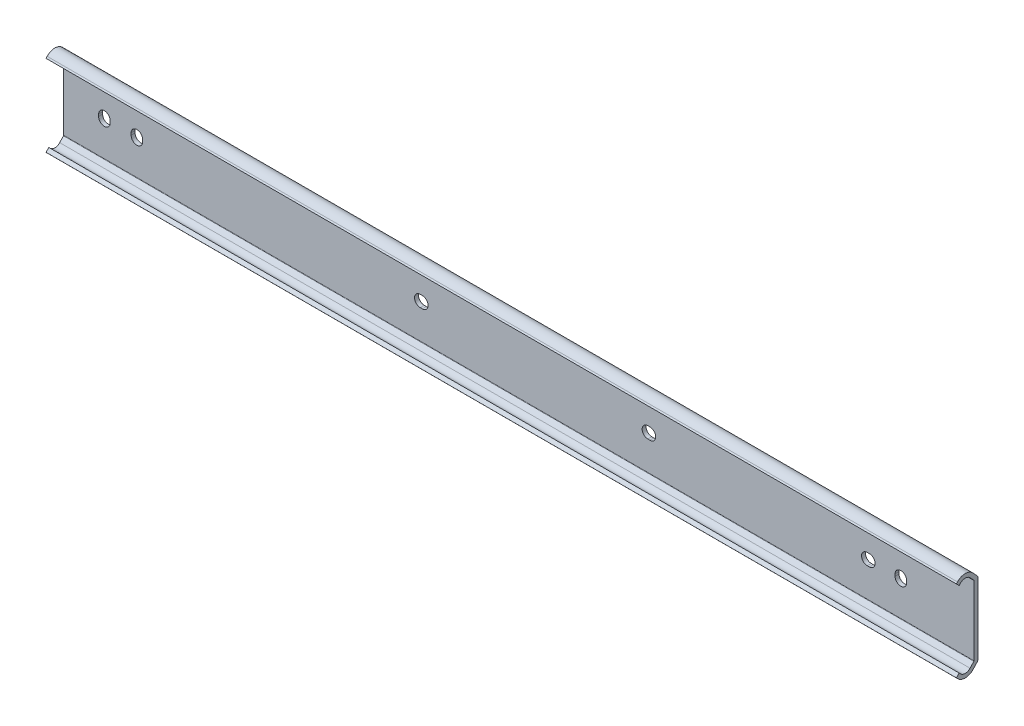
ISO-10303-21;
HEADER;
FILE_DESCRIPTION(('STEP AP214'),'2;1');
FILE_NAME('part.step','',(''),(''),'','','');
FILE_SCHEMA(('AUTOMOTIVE_DESIGN { 1 0 10303 214 1 1 1 1 }'));
ENDSEC;
DATA;
#1=APPLICATION_CONTEXT('core data for automotive mechanical design processes');
#2=APPLICATION_PROTOCOL_DEFINITION('international standard','automotive_design',2000,#1);
#3=PRODUCT_CONTEXT('',#1,'mechanical');
#4=PRODUCT('Part','Part','',(#3));
#5=PRODUCT_RELATED_PRODUCT_CATEGORY('part','',(#4));
#6=PRODUCT_DEFINITION_FORMATION('','',#4);
#7=PRODUCT_DEFINITION_CONTEXT('part definition',#1,'design');
#8=PRODUCT_DEFINITION('design','',#6,#7);
#9=PRODUCT_DEFINITION_SHAPE('','',#8);
#10=(LENGTH_UNIT() NAMED_UNIT(*) SI_UNIT(.MILLI.,.METRE.));
#11=(NAMED_UNIT(*) PLANE_ANGLE_UNIT() SI_UNIT($,.RADIAN.));
#12=(NAMED_UNIT(*) SI_UNIT($,.STERADIAN.) SOLID_ANGLE_UNIT());
#13=UNCERTAINTY_MEASURE_WITH_UNIT(LENGTH_MEASURE(1.E-05),#10,'distance_accuracy_value','');
#14=(GEOMETRIC_REPRESENTATION_CONTEXT(3) GLOBAL_UNCERTAINTY_ASSIGNED_CONTEXT((#13)) GLOBAL_UNIT_ASSIGNED_CONTEXT((#10,
#11,#12)) REPRESENTATION_CONTEXT('',''));
#15=CARTESIAN_POINT('',(0.,0.,0.));
#16=DIRECTION('',(0.,0.,1.));
#17=DIRECTION('',(1.,0.,0.));
#18=AXIS2_PLACEMENT_3D('',#15,#16,#17);
#19=CARTESIAN_POINT('',(339.7,-13.5750002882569,5.00000035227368));
#20=DIRECTION('',(-1.,0.,0.));
#21=DIRECTION('',(0.,0.,-1.));
#22=AXIS2_PLACEMENT_3D('',#19,#20,#21);
#23=CYLINDRICAL_SURFACE('',#22,2.55);
#24=CARTESIAN_POINT('',(-15.9,-13.5750002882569,5.00000035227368));
#25=DIRECTION('',(-1.,0.,0.));
#26=DIRECTION('',(0.,0.,1.));
#27=AXIS2_PLACEMENT_3D('',#24,#25,#26);
#28=CIRCLE('',#27,2.55);
#29=CARTESIAN_POINT('',(-15.9,-15.29205197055,3.11473285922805));
#30=VERTEX_POINT('',#29);
#31=CARTESIAN_POINT('',(-15.9,-15.2920940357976,6.88522953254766));
#32=VERTEX_POINT('',#31);
#33=EDGE_CURVE('E484',#30,#32,#28,.T.);
#34=ORIENTED_EDGE('',*,*,#33,.T.);
#35=DIRECTION('',(-1.,0.,0.));
#36=VECTOR('',#35,1.);
#37=CARTESIAN_POINT('',(339.7,-15.2920940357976,6.88522953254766));
#38=LINE('',#37,#36);
#39=CARTESIAN_POINT('',(339.7,-15.2920940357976,6.88522953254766));
#40=VERTEX_POINT('',#39);
#41=EDGE_CURVE('E9',#40,#32,#38,.T.);
#42=ORIENTED_EDGE('',*,*,#41,.F.);
#43=CARTESIAN_POINT('',(339.7,-13.5750002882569,5.00000035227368));
#44=DIRECTION('',(-1.,0.,0.));
#45=DIRECTION('',(0.,0.,1.));
#46=AXIS2_PLACEMENT_3D('',#43,#44,#45);
#47=CIRCLE('',#46,2.55);
#48=CARTESIAN_POINT('',(339.7,-15.29205197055,3.11473285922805));
#49=VERTEX_POINT('',#48);
#50=EDGE_CURVE('E531',#49,#40,#47,.T.);
#51=ORIENTED_EDGE('',*,*,#50,.F.);
#52=DIRECTION('',(-1.,0.,0.));
#53=VECTOR('',#52,1.);
#54=CARTESIAN_POINT('',(339.7,-15.29205197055,3.11473285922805));
#55=LINE('',#54,#53);
#56=EDGE_CURVE('E572',#49,#30,#55,.T.);
#57=ORIENTED_EDGE('',*,*,#56,.T.);
#58=EDGE_LOOP('',(#34,#42,#51,#57));
#59=FACE_BOUND('',#58,.T.);
#60=ADVANCED_FACE('F14',(#59),#23,.F.);
#61=CARTESIAN_POINT('',(339.7,-15.2920940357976,6.88522953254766));
#62=DIRECTION('',(0.,-0.692409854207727,0.721504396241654));
#63=DIRECTION('',(0.,-0.721504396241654,-0.692409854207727));
#64=AXIS2_PLACEMENT_3D('',#61,#62,#63);
#65=PLANE('',#64);
#66=DIRECTION('',(0.,0.721504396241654,0.692409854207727));
#67=VECTOR('',#66,1.);
#68=CARTESIAN_POINT('',(-15.9,-15.2920940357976,6.88522953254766));
#69=LINE('',#68,#67);
#70=CARTESIAN_POINT('',(-15.9,-14.7934626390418,7.36375370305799));
#71=VERTEX_POINT('',#70);
#72=EDGE_CURVE('E493',#32,#71,#69,.T.);
#73=ORIENTED_EDGE('',*,*,#72,.T.);
#74=DIRECTION('',(-1.,0.,0.));
#75=VECTOR('',#74,1.);
#76=CARTESIAN_POINT('',(339.7,-14.7934626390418,7.36375370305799));
#77=LINE('',#76,#75);
#78=CARTESIAN_POINT('',(339.7,-14.7934626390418,7.36375370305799));
#79=VERTEX_POINT('',#78);
#80=EDGE_CURVE('E21',#79,#71,#77,.T.);
#81=ORIENTED_EDGE('',*,*,#80,.F.);
#82=DIRECTION('',(0.,0.721504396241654,0.692409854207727));
#83=VECTOR('',#82,1.);
#84=CARTESIAN_POINT('',(339.7,-15.2920940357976,6.88522953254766));
#85=LINE('',#84,#83);
#86=EDGE_CURVE('E534',#40,#79,#85,.T.);
#87=ORIENTED_EDGE('',*,*,#86,.F.);
#88=ORIENTED_EDGE('',*,*,#41,.T.);
#89=EDGE_LOOP('',(#73,#81,#87,#88));
#90=FACE_BOUND('',#89,.T.);
#91=ADVANCED_FACE('F654',(#90),#65,.F.);
#92=CARTESIAN_POINT('',(339.7,-14.7934626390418,7.36375370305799));
#93=DIRECTION('',(0.,-0.707106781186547,-0.707106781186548));
#94=DIRECTION('',(0.,0.707106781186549,-0.707106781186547));
#95=AXIS2_PLACEMENT_3D('',#92,#93,#94);
#96=PLANE('',#95);
#97=DIRECTION('',(0.,-0.707106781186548,0.707106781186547));
#98=VECTOR('',#97,1.);
#99=CARTESIAN_POINT('',(-15.9,-14.7934626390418,7.36375370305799));
#100=LINE('',#99,#98);
#101=CARTESIAN_POINT('',(-15.9,-15.8897096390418,8.46000070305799));
#102=VERTEX_POINT('',#101);
#103=EDGE_CURVE('E495',#71,#102,#100,.T.);
#104=ORIENTED_EDGE('',*,*,#103,.T.);
#105=DIRECTION('',(-1.,0.,0.));
#106=VECTOR('',#105,1.);
#107=CARTESIAN_POINT('',(339.7,-15.8897096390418,8.46000070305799));
#108=LINE('',#107,#106);
#109=CARTESIAN_POINT('',(339.7,-15.8897096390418,8.46000070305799));
#110=VERTEX_POINT('',#109);
#111=EDGE_CURVE('E623',#110,#102,#108,.T.);
#112=ORIENTED_EDGE('',*,*,#111,.F.);
#113=DIRECTION('',(0.,-0.707106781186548,0.707106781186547));
#114=VECTOR('',#113,1.);
#115=CARTESIAN_POINT('',(339.7,-14.7934626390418,7.36375370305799));
#116=LINE('',#115,#114);
#117=EDGE_CURVE('E536',#79,#110,#116,.T.);
#118=ORIENTED_EDGE('',*,*,#117,.F.);
#119=ORIENTED_EDGE('',*,*,#80,.T.);
#120=EDGE_LOOP('',(#104,#112,#118,#119));
#121=FACE_BOUND('',#120,.T.);
#122=ADVANCED_FACE('F630',(#121),#96,.F.);
#123=CARTESIAN_POINT('',(339.7,-16.3524238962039,8.01594474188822));
#124=DIRECTION('',(0.,0.692410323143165,-0.721503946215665));
#125=DIRECTION('',(0.,0.721503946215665,0.692410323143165));
#126=AXIS2_PLACEMENT_3D('',#123,#124,#125);
#127=PLANE('',#126);
#128=DIRECTION('',(0.,-0.721503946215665,-0.692410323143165));
#129=VECTOR('',#128,1.);
#130=CARTESIAN_POINT('',(-15.9,-16.3524238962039,8.01594474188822));
#131=LINE('',#130,#129);
#132=CARTESIAN_POINT('',(-15.9,-16.3524238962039,8.01594474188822));
#133=VERTEX_POINT('',#132);
#134=EDGE_CURVE('E497',#102,#133,#131,.T.);
#135=ORIENTED_EDGE('',*,*,#134,.T.);
#136=DIRECTION('',(-1.,0.,0.));
#137=VECTOR('',#136,1.);
#138=CARTESIAN_POINT('',(339.7,-16.3524238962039,8.01594474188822));
#139=LINE('',#138,#137);
#140=CARTESIAN_POINT('',(339.7,-16.3524238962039,8.01594474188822));
#141=VERTEX_POINT('',#140);
#142=EDGE_CURVE('E620',#141,#133,#139,.T.);
#143=ORIENTED_EDGE('',*,*,#142,.F.);
#144=DIRECTION('',(0.,-0.721503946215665,-0.692410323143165));
#145=VECTOR('',#144,1.);
#146=CARTESIAN_POINT('',(339.7,-16.3524238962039,8.01594474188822));
#147=LINE('',#146,#145);
#148=EDGE_CURVE('E538',#110,#141,#147,.T.);
#149=ORIENTED_EDGE('',*,*,#148,.F.);
#150=ORIENTED_EDGE('',*,*,#111,.T.);
#151=EDGE_LOOP('',(#135,#143,#149,#150));
#152=FACE_BOUND('',#151,.T.);
#153=ADVANCED_FACE('F642',(#152),#127,.F.);
#154=CARTESIAN_POINT('',(339.7,-13.5750002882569,5.00000035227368));
#155=DIRECTION('',(-1.,0.,0.));
#156=DIRECTION('',(0.,0.,-1.));
#157=AXIS2_PLACEMENT_3D('',#154,#155,#156);
#158=CYLINDRICAL_SURFACE('',#157,4.10000029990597);
#159=CARTESIAN_POINT('',(-15.9,-13.5750002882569,5.00000035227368));
#160=DIRECTION('',(1.,0.,0.));
#161=DIRECTION('',(0.,0.,1.));
#162=AXIS2_PLACEMENT_3D('',#159,#160,#161);
#163=CIRCLE('',#162,4.10000029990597);
#164=CARTESIAN_POINT('',(-15.9,-16.4741382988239,2.10086233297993));
#165=VERTEX_POINT('',#164);
#166=EDGE_CURVE('E499',#133,#165,#163,.T.);
#167=ORIENTED_EDGE('',*,*,#166,.T.);
#168=DIRECTION('',(-1.,0.,0.));
#169=VECTOR('',#168,1.);
#170=CARTESIAN_POINT('',(339.7,-16.4741382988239,2.10086233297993));
#171=LINE('',#170,#169);
#172=CARTESIAN_POINT('',(339.7,-16.4741382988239,2.10086233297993));
#173=VERTEX_POINT('',#172);
#174=EDGE_CURVE('E617',#173,#165,#171,.T.);
#175=ORIENTED_EDGE('',*,*,#174,.F.);
#176=CARTESIAN_POINT('',(339.7,-13.5750002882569,5.00000035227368));
#177=DIRECTION('',(1.,0.,0.));
#178=DIRECTION('',(0.,0.,1.));
#179=AXIS2_PLACEMENT_3D('',#176,#177,#178);
#180=CIRCLE('',#179,4.10000029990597);
#181=EDGE_CURVE('E540',#141,#173,#180,.T.);
#182=ORIENTED_EDGE('',*,*,#181,.F.);
#183=ORIENTED_EDGE('',*,*,#142,.T.);
#184=EDGE_LOOP('',(#167,#175,#182,#183));
#185=FACE_BOUND('',#184,.T.);
#186=ADVANCED_FACE('F646',(#185),#158,.T.);
#187=CARTESIAN_POINT('',(339.7,-16.4741382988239,2.10086233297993));
#188=DIRECTION('',(0.,0.692410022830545,0.721504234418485));
#189=DIRECTION('',(0.,-0.721504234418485,0.692410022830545));
#190=AXIS2_PLACEMENT_3D('',#187,#188,#189);
#191=PLANE('',#190);
#192=DIRECTION('',(0.,0.721504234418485,-0.692410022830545));
#193=VECTOR('',#192,1.);
#194=CARTESIAN_POINT('',(-15.9,-16.4741382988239,2.10086233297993));
#195=LINE('',#194,#193);
#196=CARTESIAN_POINT('',(-15.9,-14.8073563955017,0.501292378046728));
#197=VERTEX_POINT('',#196);
#198=EDGE_CURVE('E501',#165,#197,#195,.T.);
#199=ORIENTED_EDGE('',*,*,#198,.T.);
#200=DIRECTION('',(-1.,0.,0.));
#201=VECTOR('',#200,1.);
#202=CARTESIAN_POINT('',(339.7,-14.8073563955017,0.501292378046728));
#203=LINE('',#202,#201);
#204=CARTESIAN_POINT('',(339.7,-14.8073563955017,0.501292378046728));
#205=VERTEX_POINT('',#204);
#206=EDGE_CURVE('E614',#205,#197,#203,.T.);
#207=ORIENTED_EDGE('',*,*,#206,.F.);
#208=DIRECTION('',(0.,0.721504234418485,-0.692410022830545));
#209=VECTOR('',#208,1.);
#210=CARTESIAN_POINT('',(339.7,-16.4741382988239,2.10086233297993));
#211=LINE('',#210,#209);
#212=EDGE_CURVE('E542',#173,#205,#211,.T.);
#213=ORIENTED_EDGE('',*,*,#212,.F.);
#214=ORIENTED_EDGE('',*,*,#174,.T.);
#215=EDGE_LOOP('',(#199,#207,#213,#214));
#216=FACE_BOUND('',#215,.T.);
#217=ADVANCED_FACE('F725',(#216),#191,.F.);
#218=CARTESIAN_POINT('',(339.7,-13.5610183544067,1.8));
#219=DIRECTION('',(-1.,0.,0.));
#220=DIRECTION('',(0.,0.,-1.));
#221=AXIS2_PLACEMENT_3D('',#218,#219,#220);
#222=CYLINDRICAL_SURFACE('',#221,1.8);
#223=CARTESIAN_POINT('',(-15.9,-13.5610183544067,1.8));
#224=DIRECTION('',(1.,0.,0.));
#225=DIRECTION('',(0.,0.,1.));
#226=AXIS2_PLACEMENT_3D('',#223,#224,#225);
#227=CIRCLE('',#226,1.8);
#228=CARTESIAN_POINT('',(-15.9,-13.5610183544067,0.));
#229=VERTEX_POINT('',#228);
#230=EDGE_CURVE('E503',#197,#229,#227,.T.);
#231=ORIENTED_EDGE('',*,*,#230,.T.);
#232=DIRECTION('',(-1.,0.,0.));
#233=VECTOR('',#232,1.);
#234=CARTESIAN_POINT('',(339.7,-13.5610183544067,0.));
#235=LINE('',#234,#233);
#236=CARTESIAN_POINT('',(339.7,-13.5610183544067,0.));
#237=VERTEX_POINT('',#236);
#238=EDGE_CURVE('E611',#237,#229,#235,.T.);
#239=ORIENTED_EDGE('',*,*,#238,.F.);
#240=CARTESIAN_POINT('',(339.7,-13.5610183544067,1.8));
#241=DIRECTION('',(1.,0.,0.));
#242=DIRECTION('',(0.,0.,1.));
#243=AXIS2_PLACEMENT_3D('',#240,#241,#242);
#244=CIRCLE('',#243,1.8);
#245=EDGE_CURVE('E544',#205,#237,#244,.T.);
#246=ORIENTED_EDGE('',*,*,#245,.F.);
#247=ORIENTED_EDGE('',*,*,#206,.T.);
#248=EDGE_LOOP('',(#231,#239,#246,#247));
#249=FACE_BOUND('',#248,.T.);
#250=ADVANCED_FACE('F723',(#249),#222,.T.);
#251=CARTESIAN_POINT('',(339.7,13.5610177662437,0.));
#252=DIRECTION('',(0.,0.,1.));
#253=DIRECTION('',(-1.,0.,0.));
#254=AXIS2_PLACEMENT_3D('',#251,#252,#253);
#255=PLANE('',#254);
#256=DIRECTION('',(0.,1.,0.));
#257=VECTOR('',#256,1.);
#258=CARTESIAN_POINT('',(14.95,-0.399999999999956,0.));
#259=LINE('',#258,#257);
#260=CARTESIAN_POINT('',(14.95,-0.399999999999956,0.));
#261=VERTEX_POINT('',#260);
#262=CARTESIAN_POINT('',(14.95,0.399999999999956,0.));
#263=VERTEX_POINT('',#262);
#264=EDGE_CURVE('E323',#261,#263,#259,.T.);
#265=ORIENTED_EDGE('',*,*,#264,.T.);
#266=CARTESIAN_POINT('',(12.7,0.399999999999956,0.));
#267=DIRECTION('',(0.,0.,1.));
#268=DIRECTION('',(-1.,0.,0.));
#269=AXIS2_PLACEMENT_3D('',#266,#267,#268);
#270=CIRCLE('',#269,2.24999999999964);
#271=CARTESIAN_POINT('',(10.4500000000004,0.399999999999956,0.));
#272=VERTEX_POINT('',#271);
#273=EDGE_CURVE('E314',#263,#272,#270,.T.);
#274=ORIENTED_EDGE('',*,*,#273,.T.);
#275=DIRECTION('',(0.,-1.,0.));
#276=VECTOR('',#275,1.);
#277=CARTESIAN_POINT('',(10.4500000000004,-0.399999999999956,0.));
#278=LINE('',#277,#276);
#279=CARTESIAN_POINT('',(10.4500000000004,-0.399999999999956,0.));
#280=VERTEX_POINT('',#279);
#281=EDGE_CURVE('E320',#272,#280,#278,.T.);
#282=ORIENTED_EDGE('',*,*,#281,.T.);
#283=CARTESIAN_POINT('',(12.7,-0.399999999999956,0.));
#284=DIRECTION('',(0.,0.,1.));
#285=DIRECTION('',(-1.,0.,0.));
#286=AXIS2_PLACEMENT_3D('',#283,#284,#285);
#287=CIRCLE('',#286,2.24999999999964);
#288=EDGE_CURVE('E28',#280,#261,#287,.T.);
#289=ORIENTED_EDGE('',*,*,#288,.T.);
#290=EDGE_LOOP('',(#265,#274,#282,#289));
#291=FACE_BOUND('',#290,.T.);
#292=DIRECTION('',(0.,-1.,0.));
#293=VECTOR('',#292,1.);
#294=CARTESIAN_POINT('',(-2.2499999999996,-0.399999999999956,0.));
#295=LINE('',#294,#293);
#296=CARTESIAN_POINT('',(-2.2499999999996,0.399999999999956,0.));
#297=VERTEX_POINT('',#296);
#298=CARTESIAN_POINT('',(-2.2499999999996,-0.399999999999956,0.));
#299=VERTEX_POINT('',#298);
#300=EDGE_CURVE('E350',#297,#299,#295,.T.);
#301=ORIENTED_EDGE('',*,*,#300,.T.);
#302=CARTESIAN_POINT('',(0.,-0.399999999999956,0.));
#303=DIRECTION('',(0.,0.,1.));
#304=DIRECTION('',(-1.,0.,0.));
#305=AXIS2_PLACEMENT_3D('',#302,#303,#304);
#306=CIRCLE('',#305,2.24999999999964);
#307=CARTESIAN_POINT('',(2.24999999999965,-0.399999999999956,0.));
#308=VERTEX_POINT('',#307);
#309=EDGE_CURVE('E341',#299,#308,#306,.T.);
#310=ORIENTED_EDGE('',*,*,#309,.T.);
#311=DIRECTION('',(0.,1.,0.));
#312=VECTOR('',#311,1.);
#313=CARTESIAN_POINT('',(2.24999999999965,-0.399999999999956,0.));
#314=LINE('',#313,#312);
#315=CARTESIAN_POINT('',(2.24999999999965,0.399999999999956,0.));
#316=VERTEX_POINT('',#315);
#317=EDGE_CURVE('E344',#308,#316,#314,.T.);
#318=ORIENTED_EDGE('',*,*,#317,.T.);
#319=CARTESIAN_POINT('',(0.,0.399999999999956,0.));
#320=DIRECTION('',(0.,0.,1.));
#321=DIRECTION('',(-1.,0.,0.));
#322=AXIS2_PLACEMENT_3D('',#319,#320,#321);
#323=CIRCLE('',#322,2.24999999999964);
#324=EDGE_CURVE('E347',#316,#297,#323,.T.);
#325=ORIENTED_EDGE('',*,*,#324,.T.);
#326=EDGE_LOOP('',(#301,#310,#318,#325));
#327=FACE_BOUND('',#326,.T.);
#328=DIRECTION('',(1.,0.,0.));
#329=VECTOR('',#328,1.);
#330=CARTESIAN_POINT('',(124.200428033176,-2.24999827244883,0.));
#331=LINE('',#330,#329);
#332=CARTESIAN_POINT('',(123.400428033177,-2.24999827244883,0.));
#333=VERTEX_POINT('',#332);
#334=CARTESIAN_POINT('',(124.200428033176,-2.24999827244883,0.));
#335=VERTEX_POINT('',#334);
#336=EDGE_CURVE('E382',#333,#335,#331,.T.);
#337=ORIENTED_EDGE('',*,*,#336,.T.);
#338=CARTESIAN_POINT('',(124.200428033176,1.72755114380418E-06,0.));
#339=DIRECTION('',(0.,0.,1.));
#340=DIRECTION('',(-1.,0.,0.));
#341=AXIS2_PLACEMENT_3D('',#338,#339,#340);
#342=CIRCLE('',#341,2.24999999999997);
#343=CARTESIAN_POINT('',(124.200428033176,2.25000172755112,0.));
#344=VERTEX_POINT('',#343);
#345=EDGE_CURVE('E373',#335,#344,#342,.T.);
#346=ORIENTED_EDGE('',*,*,#345,.T.);
#347=DIRECTION('',(-1.,0.,0.));
#348=VECTOR('',#347,1.);
#349=CARTESIAN_POINT('',(124.200428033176,2.25000172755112,0.));
#350=LINE('',#349,#348);
#351=CARTESIAN_POINT('',(123.400428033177,2.25000172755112,0.));
#352=VERTEX_POINT('',#351);
#353=EDGE_CURVE('E376',#344,#352,#350,.T.);
#354=ORIENTED_EDGE('',*,*,#353,.T.);
#355=CARTESIAN_POINT('',(123.400428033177,1.72755114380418E-06,0.));
#356=DIRECTION('',(0.,0.,1.));
#357=DIRECTION('',(-1.,0.,0.));
#358=AXIS2_PLACEMENT_3D('',#355,#356,#357);
#359=CIRCLE('',#358,2.24999999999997);
#360=EDGE_CURVE('E379',#352,#333,#359,.T.);
#361=ORIENTED_EDGE('',*,*,#360,.T.);
#362=EDGE_LOOP('',(#337,#346,#354,#361));
#363=FACE_BOUND('',#362,.T.);
#364=DIRECTION('',(1.,-1.04083408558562E-13,0.));
#365=VECTOR('',#364,1.);
#366=CARTESIAN_POINT('',(213.1,-2.25,0.));
#367=LINE('',#366,#365);
#368=CARTESIAN_POINT('',(212.3,-2.24999999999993,0.));
#369=VERTEX_POINT('',#368);
#370=CARTESIAN_POINT('',(213.1,-2.25,0.));
#371=VERTEX_POINT('',#370);
#372=EDGE_CURVE('E414',#369,#371,#367,.T.);
#373=ORIENTED_EDGE('',*,*,#372,.T.);
#374=CARTESIAN_POINT('',(213.1,0.,0.));
#375=DIRECTION('',(0.,0.,1.));
#376=DIRECTION('',(-1.,0.,0.));
#377=AXIS2_PLACEMENT_3D('',#374,#375,#376);
#378=CIRCLE('',#377,2.24999999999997);
#379=CARTESIAN_POINT('',(213.1,2.24999999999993,0.));
#380=VERTEX_POINT('',#379);
#381=EDGE_CURVE('E405',#371,#380,#378,.T.);
#382=ORIENTED_EDGE('',*,*,#381,.T.);
#383=DIRECTION('',(-1.,0.,0.));
#384=VECTOR('',#383,1.);
#385=CARTESIAN_POINT('',(213.1,2.24999999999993,0.));
#386=LINE('',#385,#384);
#387=CARTESIAN_POINT('',(212.3,2.24999999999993,0.));
#388=VERTEX_POINT('',#387);
#389=EDGE_CURVE('E408',#380,#388,#386,.T.);
#390=ORIENTED_EDGE('',*,*,#389,.T.);
#391=CARTESIAN_POINT('',(212.3,0.,0.));
#392=DIRECTION('',(0.,0.,1.));
#393=DIRECTION('',(-1.,0.,0.));
#394=AXIS2_PLACEMENT_3D('',#391,#392,#393);
#395=CIRCLE('',#394,2.24999999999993);
#396=EDGE_CURVE('E411',#388,#369,#395,.T.);
#397=ORIENTED_EDGE('',*,*,#396,.T.);
#398=EDGE_LOOP('',(#373,#382,#390,#397));
#399=FACE_BOUND('',#398,.T.);
#400=DIRECTION('',(1.,0.,0.));
#401=VECTOR('',#400,1.);
#402=CARTESIAN_POINT('',(298.8,-2.25,0.));
#403=LINE('',#402,#401);
#404=CARTESIAN_POINT('',(298.,-2.24999999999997,0.));
#405=VERTEX_POINT('',#404);
#406=CARTESIAN_POINT('',(298.8,-2.25,0.));
#407=VERTEX_POINT('',#406);
#408=EDGE_CURVE('E446',#405,#407,#403,.T.);
#409=ORIENTED_EDGE('',*,*,#408,.T.);
#410=CARTESIAN_POINT('',(298.8,0.,0.));
#411=DIRECTION('',(0.,0.,1.));
#412=DIRECTION('',(-1.,0.,0.));
#413=AXIS2_PLACEMENT_3D('',#410,#411,#412);
#414=CIRCLE('',#413,2.24999999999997);
#415=CARTESIAN_POINT('',(298.8,2.24999999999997,0.));
#416=VERTEX_POINT('',#415);
#417=EDGE_CURVE('E437',#407,#416,#414,.T.);
#418=ORIENTED_EDGE('',*,*,#417,.T.);
#419=DIRECTION('',(-1.,0.,0.));
#420=VECTOR('',#419,1.);
#421=CARTESIAN_POINT('',(298.8,2.24999999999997,0.));
#422=LINE('',#421,#420);
#423=CARTESIAN_POINT('',(298.,2.24999999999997,0.));
#424=VERTEX_POINT('',#423);
#425=EDGE_CURVE('E440',#416,#424,#422,.T.);
#426=ORIENTED_EDGE('',*,*,#425,.T.);
#427=CARTESIAN_POINT('',(298.,0.,0.));
#428=DIRECTION('',(0.,0.,1.));
#429=DIRECTION('',(-1.,0.,0.));
#430=AXIS2_PLACEMENT_3D('',#427,#428,#429);
#431=CIRCLE('',#430,2.24999999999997);
#432=EDGE_CURVE('E443',#424,#405,#431,.T.);
#433=ORIENTED_EDGE('',*,*,#432,.T.);
#434=EDGE_LOOP('',(#409,#418,#426,#433));
#435=FACE_BOUND('',#434,.T.);
#436=DIRECTION('',(0.,1.,0.));
#437=VECTOR('',#436,1.);
#438=CARTESIAN_POINT('',(313.35,-0.399999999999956,0.));
#439=LINE('',#438,#437);
#440=CARTESIAN_POINT('',(313.35,-0.399999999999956,0.));
#441=VERTEX_POINT('',#440);
#442=CARTESIAN_POINT('',(313.35,0.399999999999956,0.));
#443=VERTEX_POINT('',#442);
#444=EDGE_CURVE('E478',#441,#443,#439,.T.);
#445=ORIENTED_EDGE('',*,*,#444,.T.);
#446=CARTESIAN_POINT('',(311.1,0.399999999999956,0.));
#447=DIRECTION('',(0.,0.,1.));
#448=DIRECTION('',(-1.,0.,0.));
#449=AXIS2_PLACEMENT_3D('',#446,#447,#448);
#450=CIRCLE('',#449,2.24999999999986);
#451=CARTESIAN_POINT('',(308.85,0.399999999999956,0.));
#452=VERTEX_POINT('',#451);
#453=EDGE_CURVE('E469',#443,#452,#450,.T.);
#454=ORIENTED_EDGE('',*,*,#453,.T.);
#455=DIRECTION('',(0.,-1.,0.));
#456=VECTOR('',#455,1.);
#457=CARTESIAN_POINT('',(308.85,-0.399999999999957,0.));
#458=LINE('',#457,#456);
#459=CARTESIAN_POINT('',(308.85,-0.399999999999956,0.));
#460=VERTEX_POINT('',#459);
#461=EDGE_CURVE('E472',#452,#460,#458,.T.);
#462=ORIENTED_EDGE('',*,*,#461,.T.);
#463=CARTESIAN_POINT('',(311.1,-0.399999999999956,0.));
#464=DIRECTION('',(0.,0.,1.));
#465=DIRECTION('',(-1.,0.,0.));
#466=AXIS2_PLACEMENT_3D('',#463,#464,#465);
#467=CIRCLE('',#466,2.24999999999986);
#468=EDGE_CURVE('E475',#460,#441,#467,.T.);
#469=ORIENTED_EDGE('',*,*,#468,.T.);
#470=EDGE_LOOP('',(#445,#454,#462,#469));
#471=FACE_BOUND('',#470,.T.);
#472=DIRECTION('',(0.,1.,0.));
#473=VECTOR('',#472,1.);
#474=CARTESIAN_POINT('',(-15.9,13.5610177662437,0.));
#475=LINE('',#474,#473);
#476=CARTESIAN_POINT('',(-15.9,13.5610177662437,0.));
#477=VERTEX_POINT('',#476);
#478=EDGE_CURVE('E505',#229,#477,#475,.T.);
#479=ORIENTED_EDGE('',*,*,#478,.T.);
#480=DIRECTION('',(-1.,0.,0.));
#481=VECTOR('',#480,1.);
#482=CARTESIAN_POINT('',(339.7,13.5610177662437,0.));
#483=LINE('',#482,#481);
#484=CARTESIAN_POINT('',(339.7,13.5610177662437,0.));
#485=VERTEX_POINT('',#484);
#486=EDGE_CURVE('E608',#485,#477,#483,.T.);
#487=ORIENTED_EDGE('',*,*,#486,.F.);
#488=DIRECTION('',(0.,1.,0.));
#489=VECTOR('',#488,1.);
#490=CARTESIAN_POINT('',(339.7,13.5610177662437,0.));
#491=LINE('',#490,#489);
#492=EDGE_CURVE('E546',#237,#485,#491,.T.);
#493=ORIENTED_EDGE('',*,*,#492,.F.);
#494=ORIENTED_EDGE('',*,*,#238,.T.);
#495=EDGE_LOOP('',(#479,#487,#493,#494));
#496=FACE_BOUND('',#495,.T.);
#497=ADVANCED_FACE('F718',(#291,#327,#363,#399,#435,#471,#496),#255,.F.);
#498=CARTESIAN_POINT('',(339.7,13.5610177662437,1.8));
#499=DIRECTION('',(-1.,0.,0.));
#500=DIRECTION('',(0.,0.,-1.));
#501=AXIS2_PLACEMENT_3D('',#498,#499,#500);
#502=CYLINDRICAL_SURFACE('',#501,1.8);
#503=CARTESIAN_POINT('',(-15.9,13.5610177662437,1.8));
#504=DIRECTION('',(1.,0.,0.));
#505=DIRECTION('',(0.,0.,-1.));
#506=AXIS2_PLACEMENT_3D('',#503,#504,#505);
#507=CIRCLE('',#506,1.8);
#508=CARTESIAN_POINT('',(-15.9,14.8073558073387,0.501292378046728));
#509=VERTEX_POINT('',#508);
#510=EDGE_CURVE('E507',#477,#509,#507,.T.);
#511=ORIENTED_EDGE('',*,*,#510,.T.);
#512=DIRECTION('',(-1.,0.,0.));
#513=VECTOR('',#512,1.);
#514=CARTESIAN_POINT('',(339.7,14.8073558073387,0.501292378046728));
#515=LINE('',#514,#513);
#516=CARTESIAN_POINT('',(339.7,14.8073558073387,0.501292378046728));
#517=VERTEX_POINT('',#516);
#518=EDGE_CURVE('E605',#517,#509,#515,.T.);
#519=ORIENTED_EDGE('',*,*,#518,.F.);
#520=CARTESIAN_POINT('',(339.7,13.5610177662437,1.8));
#521=DIRECTION('',(1.,0.,0.));
#522=DIRECTION('',(0.,0.,-1.));
#523=AXIS2_PLACEMENT_3D('',#520,#521,#522);
#524=CIRCLE('',#523,1.8);
#525=EDGE_CURVE('E548',#485,#517,#524,.T.);
#526=ORIENTED_EDGE('',*,*,#525,.F.);
#527=ORIENTED_EDGE('',*,*,#486,.T.);
#528=EDGE_LOOP('',(#511,#519,#526,#527));
#529=FACE_BOUND('',#528,.T.);
#530=ADVANCED_FACE('F713',(#529),#502,.T.);
#531=CARTESIAN_POINT('',(339.7,16.474137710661,2.10086233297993));
#532=DIRECTION('',(0.,-0.692410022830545,0.721504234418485));
#533=DIRECTION('',(0.,-0.721504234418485,-0.692410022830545));
#534=AXIS2_PLACEMENT_3D('',#531,#532,#533);
#535=PLANE('',#534);
#536=DIRECTION('',(0.,0.721504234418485,0.692410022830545));
#537=VECTOR('',#536,1.);
#538=CARTESIAN_POINT('',(-15.9,16.474137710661,2.10086233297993));
#539=LINE('',#538,#537);
#540=CARTESIAN_POINT('',(-15.9,16.474137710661,2.10086233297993));
#541=VERTEX_POINT('',#540);
#542=EDGE_CURVE('E509',#509,#541,#539,.T.);
#543=ORIENTED_EDGE('',*,*,#542,.T.);
#544=DIRECTION('',(-1.,0.,0.));
#545=VECTOR('',#544,1.);
#546=CARTESIAN_POINT('',(339.7,16.474137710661,2.10086233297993));
#547=LINE('',#546,#545);
#548=CARTESIAN_POINT('',(339.7,16.474137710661,2.10086233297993));
#549=VERTEX_POINT('',#548);
#550=EDGE_CURVE('E602',#549,#541,#547,.T.);
#551=ORIENTED_EDGE('',*,*,#550,.F.);
#552=DIRECTION('',(0.,0.721504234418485,0.692410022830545));
#553=VECTOR('',#552,1.);
#554=CARTESIAN_POINT('',(339.7,16.474137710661,2.10086233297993));
#555=LINE('',#554,#553);
#556=EDGE_CURVE('E550',#517,#549,#555,.T.);
#557=ORIENTED_EDGE('',*,*,#556,.F.);
#558=ORIENTED_EDGE('',*,*,#518,.T.);
#559=EDGE_LOOP('',(#543,#551,#557,#558));
#560=FACE_BOUND('',#559,.T.);
#561=ADVANCED_FACE('F709',(#560),#535,.F.);
#562=CARTESIAN_POINT('',(339.7,13.5749997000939,5.00000035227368));
#563=DIRECTION('',(-1.,0.,0.));
#564=DIRECTION('',(0.,0.,-1.));
#565=AXIS2_PLACEMENT_3D('',#562,#563,#564);
#566=CYLINDRICAL_SURFACE('',#565,4.10000029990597);
#567=CARTESIAN_POINT('',(-15.9,13.5749997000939,5.00000035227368));
#568=DIRECTION('',(1.,0.,0.));
#569=DIRECTION('',(0.,0.,-1.));
#570=AXIS2_PLACEMENT_3D('',#567,#568,#569);
#571=CIRCLE('',#570,4.10000029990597);
#572=CARTESIAN_POINT('',(-15.9,16.3524233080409,8.01594474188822));
#573=VERTEX_POINT('',#572);
#574=EDGE_CURVE('E511',#541,#573,#571,.T.);
#575=ORIENTED_EDGE('',*,*,#574,.T.);
#576=DIRECTION('',(-1.,0.,0.));
#577=VECTOR('',#576,1.);
#578=CARTESIAN_POINT('',(339.7,16.3524233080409,8.01594474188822));
#579=LINE('',#578,#577);
#580=CARTESIAN_POINT('',(339.7,16.3524233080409,8.01594474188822));
#581=VERTEX_POINT('',#580);
#582=EDGE_CURVE('E599',#581,#573,#579,.T.);
#583=ORIENTED_EDGE('',*,*,#582,.F.);
#584=CARTESIAN_POINT('',(339.7,13.5749997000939,5.00000035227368));
#585=DIRECTION('',(1.,0.,0.));
#586=DIRECTION('',(0.,0.,-1.));
#587=AXIS2_PLACEMENT_3D('',#584,#585,#586);
#588=CIRCLE('',#587,4.10000029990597);
#589=EDGE_CURVE('E552',#549,#581,#588,.T.);
#590=ORIENTED_EDGE('',*,*,#589,.F.);
#591=ORIENTED_EDGE('',*,*,#550,.T.);
#592=EDGE_LOOP('',(#575,#583,#590,#591));
#593=FACE_BOUND('',#592,.T.);
#594=ADVANCED_FACE('F704',(#593),#566,.T.);
#595=CARTESIAN_POINT('',(339.7,16.3524233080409,8.01594474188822));
#596=DIRECTION('',(0.,-0.692410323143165,-0.721503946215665));
#597=DIRECTION('',(0.,0.721503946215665,-0.692410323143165));
#598=AXIS2_PLACEMENT_3D('',#595,#596,#597);
#599=PLANE('',#598);
#600=DIRECTION('',(0.,-0.721503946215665,0.692410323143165));
#601=VECTOR('',#600,1.);
#602=CARTESIAN_POINT('',(-15.9,16.3524233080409,8.01594474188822));
#603=LINE('',#602,#601);
#604=CARTESIAN_POINT('',(-15.9,15.8897090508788,8.46000070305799));
#605=VERTEX_POINT('',#604);
#606=EDGE_CURVE('E513',#573,#605,#603,.T.);
#607=ORIENTED_EDGE('',*,*,#606,.T.);
#608=DIRECTION('',(-1.,0.,0.));
#609=VECTOR('',#608,1.);
#610=CARTESIAN_POINT('',(339.7,15.8897090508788,8.46000070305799));
#611=LINE('',#610,#609);
#612=CARTESIAN_POINT('',(339.7,15.8897090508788,8.46000070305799));
#613=VERTEX_POINT('',#612);
#614=EDGE_CURVE('E596',#613,#605,#611,.T.);
#615=ORIENTED_EDGE('',*,*,#614,.F.);
#616=DIRECTION('',(0.,-0.721503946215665,0.692410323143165));
#617=VECTOR('',#616,1.);
#618=CARTESIAN_POINT('',(339.7,16.3524233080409,8.01594474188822));
#619=LINE('',#618,#617);
#620=EDGE_CURVE('E554',#581,#613,#619,.T.);
#621=ORIENTED_EDGE('',*,*,#620,.F.);
#622=ORIENTED_EDGE('',*,*,#582,.T.);
#623=EDGE_LOOP('',(#607,#615,#621,#622));
#624=FACE_BOUND('',#623,.T.);
#625=ADVANCED_FACE('F698',(#624),#599,.F.);
#626=CARTESIAN_POINT('',(339.7,14.7934620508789,7.36375370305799));
#627=DIRECTION('',(0.,0.707106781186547,-0.707106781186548));
#628=DIRECTION('',(0.,0.707106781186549,0.707106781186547));
#629=AXIS2_PLACEMENT_3D('',#626,#627,#628);
#630=PLANE('',#629);
#631=DIRECTION('',(0.,-0.707106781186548,-0.707106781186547));
#632=VECTOR('',#631,1.);
#633=CARTESIAN_POINT('',(-15.9,14.7934620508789,7.36375370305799));
#634=LINE('',#633,#632);
#635=CARTESIAN_POINT('',(-15.9,14.7934620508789,7.36375370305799));
#636=VERTEX_POINT('',#635);
#637=EDGE_CURVE('E515',#605,#636,#634,.T.);
#638=ORIENTED_EDGE('',*,*,#637,.T.);
#639=DIRECTION('',(-1.,0.,0.));
#640=VECTOR('',#639,1.);
#641=CARTESIAN_POINT('',(339.7,14.7934620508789,7.36375370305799));
#642=LINE('',#641,#640);
#643=CARTESIAN_POINT('',(339.7,14.7934620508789,7.36375370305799));
#644=VERTEX_POINT('',#643);
#645=EDGE_CURVE('E593',#644,#636,#642,.T.);
#646=ORIENTED_EDGE('',*,*,#645,.F.);
#647=DIRECTION('',(0.,-0.707106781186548,-0.707106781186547));
#648=VECTOR('',#647,1.);
#649=CARTESIAN_POINT('',(339.7,14.7934620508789,7.36375370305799));
#650=LINE('',#649,#648);
#651=EDGE_CURVE('E556',#613,#644,#650,.T.);
#652=ORIENTED_EDGE('',*,*,#651,.F.);
#653=ORIENTED_EDGE('',*,*,#614,.T.);
#654=EDGE_LOOP('',(#638,#646,#652,#653));
#655=FACE_BOUND('',#654,.T.);
#656=ADVANCED_FACE('F694',(#655),#630,.F.);
#657=CARTESIAN_POINT('',(339.7,15.2920934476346,6.88522953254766));
#658=DIRECTION('',(0.,0.692409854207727,0.721504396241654));
#659=DIRECTION('',(0.,-0.721504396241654,0.692409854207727));
#660=AXIS2_PLACEMENT_3D('',#657,#658,#659);
#661=PLANE('',#660);
#662=DIRECTION('',(0.,0.721504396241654,-0.692409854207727));
#663=VECTOR('',#662,1.);
#664=CARTESIAN_POINT('',(-15.9,15.2920934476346,6.88522953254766));
#665=LINE('',#664,#663);
#666=CARTESIAN_POINT('',(-15.9,15.2920934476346,6.88522953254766));
#667=VERTEX_POINT('',#666);
#668=EDGE_CURVE('E517',#636,#667,#665,.T.);
#669=ORIENTED_EDGE('',*,*,#668,.T.);
#670=DIRECTION('',(-1.,0.,0.));
#671=VECTOR('',#670,1.);
#672=CARTESIAN_POINT('',(339.7,15.2920934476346,6.88522953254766));
#673=LINE('',#672,#671);
#674=CARTESIAN_POINT('',(339.7,15.2920934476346,6.88522953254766));
#675=VERTEX_POINT('',#674);
#676=EDGE_CURVE('E590',#675,#667,#673,.T.);
#677=ORIENTED_EDGE('',*,*,#676,.F.);
#678=DIRECTION('',(0.,0.721504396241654,-0.692409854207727));
#679=VECTOR('',#678,1.);
#680=CARTESIAN_POINT('',(339.7,15.2920934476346,6.88522953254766));
#681=LINE('',#680,#679);
#682=EDGE_CURVE('E558',#644,#675,#681,.T.);
#683=ORIENTED_EDGE('',*,*,#682,.F.);
#684=ORIENTED_EDGE('',*,*,#645,.T.);
#685=EDGE_LOOP('',(#669,#677,#683,#684));
#686=FACE_BOUND('',#685,.T.);
#687=ADVANCED_FACE('F689',(#686),#661,.F.);
#688=CARTESIAN_POINT('',(339.7,13.5749997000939,5.00000035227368));
#689=DIRECTION('',(-1.,0.,0.));
#690=DIRECTION('',(0.,0.,-1.));
#691=AXIS2_PLACEMENT_3D('',#688,#689,#690);
#692=CYLINDRICAL_SURFACE('',#691,2.55);
#693=CARTESIAN_POINT('',(-15.9,13.5749997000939,5.00000035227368));
#694=DIRECTION('',(-1.,0.,0.));
#695=DIRECTION('',(0.,0.,-1.));
#696=AXIS2_PLACEMENT_3D('',#693,#694,#695);
#697=CIRCLE('',#696,2.55);
#698=CARTESIAN_POINT('',(-15.9,15.292051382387,3.11473285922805));
#699=VERTEX_POINT('',#698);
#700=EDGE_CURVE('E519',#667,#699,#697,.T.);
#701=ORIENTED_EDGE('',*,*,#700,.T.);
#702=DIRECTION('',(-1.,0.,0.));
#703=VECTOR('',#702,1.);
#704=CARTESIAN_POINT('',(339.7,15.292051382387,3.11473285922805));
#705=LINE('',#704,#703);
#706=CARTESIAN_POINT('',(339.7,15.292051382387,3.11473285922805));
#707=VERTEX_POINT('',#706);
#708=EDGE_CURVE('E587',#707,#699,#705,.T.);
#709=ORIENTED_EDGE('',*,*,#708,.F.);
#710=CARTESIAN_POINT('',(339.7,13.5749997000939,5.00000035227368));
#711=DIRECTION('',(-1.,0.,0.));
#712=DIRECTION('',(0.,0.,-1.));
#713=AXIS2_PLACEMENT_3D('',#710,#711,#712);
#714=CIRCLE('',#713,2.55);
#715=EDGE_CURVE('E560',#675,#707,#714,.T.);
#716=ORIENTED_EDGE('',*,*,#715,.F.);
#717=ORIENTED_EDGE('',*,*,#676,.T.);
#718=EDGE_LOOP('',(#701,#709,#716,#717));
#719=FACE_BOUND('',#718,.T.);
#720=ADVANCED_FACE('F683',(#719),#692,.F.);
#721=CARTESIAN_POINT('',(339.7,15.292051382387,3.11473285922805));
#722=DIRECTION('',(0.,0.692410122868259,-0.721504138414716));
#723=DIRECTION('',(0.,0.721504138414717,0.692410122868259));
#724=AXIS2_PLACEMENT_3D('',#721,#722,#723);
#725=PLANE('',#724);
#726=DIRECTION('',(0.,-0.721504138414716,-0.692410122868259));
#727=VECTOR('',#726,1.);
#728=CARTESIAN_POINT('',(-15.9,15.292051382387,3.11473285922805));
#729=LINE('',#728,#727);
#730=CARTESIAN_POINT('',(-15.9,13.7341202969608,1.61962396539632));
#731=VERTEX_POINT('',#730);
#732=EDGE_CURVE('E521',#699,#731,#729,.T.);
#733=ORIENTED_EDGE('',*,*,#732,.T.);
#734=DIRECTION('',(-1.,0.,0.));
#735=VECTOR('',#734,1.);
#736=CARTESIAN_POINT('',(339.7,13.7341202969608,1.61962396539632));
#737=LINE('',#736,#735);
#738=CARTESIAN_POINT('',(339.7,13.7341202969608,1.61962396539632));
#739=VERTEX_POINT('',#738);
#740=EDGE_CURVE('E584',#739,#731,#737,.T.);
#741=ORIENTED_EDGE('',*,*,#740,.F.);
#742=DIRECTION('',(0.,-0.721504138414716,-0.692410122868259));
#743=VECTOR('',#742,1.);
#744=CARTESIAN_POINT('',(339.7,15.292051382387,3.11473285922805));
#745=LINE('',#744,#743);
#746=EDGE_CURVE('E562',#707,#739,#745,.T.);
#747=ORIENTED_EDGE('',*,*,#746,.F.);
#748=ORIENTED_EDGE('',*,*,#708,.T.);
#749=EDGE_LOOP('',(#733,#741,#747,#748));
#750=FACE_BOUND('',#749,.T.);
#751=ADVANCED_FACE('F679',(#750),#725,.F.);
#752=CARTESIAN_POINT('',(339.7,13.5610177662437,1.8));
#753=DIRECTION('',(-1.,0.,0.));
#754=DIRECTION('',(0.,0.,-1.));
#755=AXIS2_PLACEMENT_3D('',#752,#753,#754);
#756=CYLINDRICAL_SURFACE('',#755,0.249999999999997);
#757=CARTESIAN_POINT('',(-15.9,13.5610177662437,1.8));
#758=DIRECTION('',(-1.,0.,0.));
#759=DIRECTION('',(0.,0.,1.));
#760=AXIS2_PLACEMENT_3D('',#757,#758,#759);
#761=CIRCLE('',#760,0.249999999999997);
#762=CARTESIAN_POINT('',(-15.9,13.5610177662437,1.55));
#763=VERTEX_POINT('',#762);
#764=EDGE_CURVE('E523',#731,#763,#761,.T.);
#765=ORIENTED_EDGE('',*,*,#764,.T.);
#766=DIRECTION('',(-1.,0.,0.));
#767=VECTOR('',#766,1.);
#768=CARTESIAN_POINT('',(339.7,13.5610177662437,1.55));
#769=LINE('',#768,#767);
#770=CARTESIAN_POINT('',(339.7,13.5610177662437,1.55));
#771=VERTEX_POINT('',#770);
#772=EDGE_CURVE('E581',#771,#763,#769,.T.);
#773=ORIENTED_EDGE('',*,*,#772,.F.);
#774=CARTESIAN_POINT('',(339.7,13.5610177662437,1.8));
#775=DIRECTION('',(-1.,0.,0.));
#776=DIRECTION('',(0.,0.,1.));
#777=AXIS2_PLACEMENT_3D('',#774,#775,#776);
#778=CIRCLE('',#777,0.249999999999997);
#779=EDGE_CURVE('E564',#739,#771,#778,.T.);
#780=ORIENTED_EDGE('',*,*,#779,.F.);
#781=ORIENTED_EDGE('',*,*,#740,.T.);
#782=EDGE_LOOP('',(#765,#773,#780,#781));
#783=FACE_BOUND('',#782,.T.);
#784=ADVANCED_FACE('F674',(#783),#756,.F.);
#785=CARTESIAN_POINT('',(339.7,13.5610177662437,1.55));
#786=DIRECTION('',(0.,0.,-1.));
#787=DIRECTION('',(1.,0.,0.));
#788=AXIS2_PLACEMENT_3D('',#785,#786,#787);
#789=PLANE('',#788);
#790=DIRECTION('',(0.,-1.,0.));
#791=VECTOR('',#790,1.);
#792=CARTESIAN_POINT('',(10.4500000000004,-0.399999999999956,1.55));
#793=LINE('',#792,#791);
#794=CARTESIAN_POINT('',(10.4500000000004,0.399999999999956,1.55));
#795=VERTEX_POINT('',#794);
#796=CARTESIAN_POINT('',(10.4500000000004,-0.399999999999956,1.55));
#797=VERTEX_POINT('',#796);
#798=EDGE_CURVE('E305',#795,#797,#793,.T.);
#799=ORIENTED_EDGE('',*,*,#798,.F.);
#800=CARTESIAN_POINT('',(12.7,0.399999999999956,1.55));
#801=DIRECTION('',(0.,0.,1.));
#802=DIRECTION('',(-1.,0.,0.));
#803=AXIS2_PLACEMENT_3D('',#800,#801,#802);
#804=CIRCLE('',#803,2.24999999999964);
#805=CARTESIAN_POINT('',(14.95,0.399999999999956,1.55));
#806=VERTEX_POINT('',#805);
#807=EDGE_CURVE('E36',#806,#795,#804,.T.);
#808=ORIENTED_EDGE('',*,*,#807,.F.);
#809=DIRECTION('',(0.,1.,0.));
#810=VECTOR('',#809,1.);
#811=CARTESIAN_POINT('',(14.95,-0.399999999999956,1.55));
#812=LINE('',#811,#810);
#813=CARTESIAN_POINT('',(14.95,-0.399999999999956,1.55));
#814=VERTEX_POINT('',#813);
#815=EDGE_CURVE('E312',#814,#806,#812,.T.);
#816=ORIENTED_EDGE('',*,*,#815,.F.);
#817=CARTESIAN_POINT('',(12.7,-0.399999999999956,1.55));
#818=DIRECTION('',(0.,0.,1.));
#819=DIRECTION('',(-1.,0.,0.));
#820=AXIS2_PLACEMENT_3D('',#817,#818,#819);
#821=CIRCLE('',#820,2.24999999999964);
#822=EDGE_CURVE('E296',#797,#814,#821,.T.);
#823=ORIENTED_EDGE('',*,*,#822,.F.);
#824=EDGE_LOOP('',(#799,#808,#816,#823));
#825=FACE_BOUND('',#824,.T.);
#826=DIRECTION('',(0.,1.,0.));
#827=VECTOR('',#826,1.);
#828=CARTESIAN_POINT('',(2.24999999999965,-0.399999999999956,1.55));
#829=LINE('',#828,#827);
#830=CARTESIAN_POINT('',(2.24999999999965,-0.399999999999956,1.55));
#831=VERTEX_POINT('',#830);
#832=CARTESIAN_POINT('',(2.24999999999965,0.399999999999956,1.55));
#833=VERTEX_POINT('',#832);
#834=EDGE_CURVE('E332',#831,#833,#829,.T.);
#835=ORIENTED_EDGE('',*,*,#834,.F.);
#836=CARTESIAN_POINT('',(0.,-0.399999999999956,1.55));
#837=DIRECTION('',(0.,0.,1.));
#838=DIRECTION('',(-1.,0.,0.));
#839=AXIS2_PLACEMENT_3D('',#836,#837,#838);
#840=CIRCLE('',#839,2.24999999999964);
#841=CARTESIAN_POINT('',(-2.2499999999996,-0.399999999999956,1.55));
#842=VERTEX_POINT('',#841);
#843=EDGE_CURVE('E328',#842,#831,#840,.T.);
#844=ORIENTED_EDGE('',*,*,#843,.F.);
#845=DIRECTION('',(0.,-1.,0.));
#846=VECTOR('',#845,1.);
#847=CARTESIAN_POINT('',(-2.2499999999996,-0.399999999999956,1.55));
#848=LINE('',#847,#846);
#849=CARTESIAN_POINT('',(-2.2499999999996,0.399999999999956,1.55));
#850=VERTEX_POINT('',#849);
#851=EDGE_CURVE('E338',#850,#842,#848,.T.);
#852=ORIENTED_EDGE('',*,*,#851,.F.);
#853=CARTESIAN_POINT('',(0.,0.399999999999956,1.55));
#854=DIRECTION('',(0.,0.,1.));
#855=DIRECTION('',(-1.,0.,0.));
#856=AXIS2_PLACEMENT_3D('',#853,#854,#855);
#857=CIRCLE('',#856,2.24999999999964);
#858=EDGE_CURVE('E335',#833,#850,#857,.T.);
#859=ORIENTED_EDGE('',*,*,#858,.F.);
#860=EDGE_LOOP('',(#835,#844,#852,#859));
#861=FACE_BOUND('',#860,.T.);
#862=DIRECTION('',(-1.,0.,0.));
#863=VECTOR('',#862,1.);
#864=CARTESIAN_POINT('',(124.200428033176,2.25000172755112,1.55));
#865=LINE('',#864,#863);
#866=CARTESIAN_POINT('',(124.200428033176,2.25000172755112,1.55));
#867=VERTEX_POINT('',#866);
#868=CARTESIAN_POINT('',(123.400428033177,2.25000172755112,1.55));
#869=VERTEX_POINT('',#868);
#870=EDGE_CURVE('E364',#867,#869,#865,.T.);
#871=ORIENTED_EDGE('',*,*,#870,.F.);
#872=CARTESIAN_POINT('',(124.200428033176,1.72755114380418E-06,1.55));
#873=DIRECTION('',(0.,0.,1.));
#874=DIRECTION('',(-1.,0.,0.));
#875=AXIS2_PLACEMENT_3D('',#872,#873,#874);
#876=CIRCLE('',#875,2.24999999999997);
#877=CARTESIAN_POINT('',(124.200428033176,-2.24999827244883,1.55));
#878=VERTEX_POINT('',#877);
#879=EDGE_CURVE('E356',#878,#867,#876,.T.);
#880=ORIENTED_EDGE('',*,*,#879,.F.);
#881=DIRECTION('',(1.,0.,0.));
#882=VECTOR('',#881,1.);
#883=CARTESIAN_POINT('',(124.200428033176,-2.24999827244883,1.55));
#884=LINE('',#883,#882);
#885=CARTESIAN_POINT('',(123.400428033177,-2.24999827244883,1.55));
#886=VERTEX_POINT('',#885);
#887=EDGE_CURVE('E370',#886,#878,#884,.T.);
#888=ORIENTED_EDGE('',*,*,#887,.F.);
#889=CARTESIAN_POINT('',(123.400428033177,1.72755114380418E-06,1.55));
#890=DIRECTION('',(0.,0.,1.));
#891=DIRECTION('',(-1.,0.,0.));
#892=AXIS2_PLACEMENT_3D('',#889,#890,#891);
#893=CIRCLE('',#892,2.24999999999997);
#894=EDGE_CURVE('E367',#869,#886,#893,.T.);
#895=ORIENTED_EDGE('',*,*,#894,.F.);
#896=EDGE_LOOP('',(#871,#880,#888,#895));
#897=FACE_BOUND('',#896,.T.);
#898=DIRECTION('',(-1.,0.,0.));
#899=VECTOR('',#898,1.);
#900=CARTESIAN_POINT('',(213.1,2.24999999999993,1.55));
#901=LINE('',#900,#899);
#902=CARTESIAN_POINT('',(213.1,2.24999999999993,1.55));
#903=VERTEX_POINT('',#902);
#904=CARTESIAN_POINT('',(212.3,2.24999999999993,1.55));
#905=VERTEX_POINT('',#904);
#906=EDGE_CURVE('E396',#903,#905,#901,.T.);
#907=ORIENTED_EDGE('',*,*,#906,.F.);
#908=CARTESIAN_POINT('',(213.1,0.,1.55));
#909=DIRECTION('',(0.,0.,1.));
#910=DIRECTION('',(-1.,0.,0.));
#911=AXIS2_PLACEMENT_3D('',#908,#909,#910);
#912=CIRCLE('',#911,2.24999999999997);
#913=CARTESIAN_POINT('',(213.1,-2.25,1.55));
#914=VERTEX_POINT('',#913);
#915=EDGE_CURVE('E388',#914,#903,#912,.T.);
#916=ORIENTED_EDGE('',*,*,#915,.F.);
#917=DIRECTION('',(1.,-1.04083408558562E-13,0.));
#918=VECTOR('',#917,1.);
#919=CARTESIAN_POINT('',(213.1,-2.25,1.55));
#920=LINE('',#919,#918);
#921=CARTESIAN_POINT('',(212.3,-2.24999999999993,1.55));
#922=VERTEX_POINT('',#921);
#923=EDGE_CURVE('E402',#922,#914,#920,.T.);
#924=ORIENTED_EDGE('',*,*,#923,.F.);
#925=CARTESIAN_POINT('',(212.3,0.,1.55));
#926=DIRECTION('',(0.,0.,1.));
#927=DIRECTION('',(-1.,0.,0.));
#928=AXIS2_PLACEMENT_3D('',#925,#926,#927);
#929=CIRCLE('',#928,2.24999999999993);
#930=EDGE_CURVE('E399',#905,#922,#929,.T.);
#931=ORIENTED_EDGE('',*,*,#930,.F.);
#932=EDGE_LOOP('',(#907,#916,#924,#931));
#933=FACE_BOUND('',#932,.T.);
#934=DIRECTION('',(-1.,0.,0.));
#935=VECTOR('',#934,1.);
#936=CARTESIAN_POINT('',(298.8,2.24999999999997,1.55));
#937=LINE('',#936,#935);
#938=CARTESIAN_POINT('',(298.8,2.24999999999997,1.55));
#939=VERTEX_POINT('',#938);
#940=CARTESIAN_POINT('',(298.,2.24999999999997,1.55));
#941=VERTEX_POINT('',#940);
#942=EDGE_CURVE('E428',#939,#941,#937,.T.);
#943=ORIENTED_EDGE('',*,*,#942,.F.);
#944=CARTESIAN_POINT('',(298.8,0.,1.55));
#945=DIRECTION('',(0.,0.,1.));
#946=DIRECTION('',(-1.,0.,0.));
#947=AXIS2_PLACEMENT_3D('',#944,#945,#946);
#948=CIRCLE('',#947,2.24999999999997);
#949=CARTESIAN_POINT('',(298.8,-2.25,1.55));
#950=VERTEX_POINT('',#949);
#951=EDGE_CURVE('E420',#950,#939,#948,.T.);
#952=ORIENTED_EDGE('',*,*,#951,.F.);
#953=DIRECTION('',(1.,0.,0.));
#954=VECTOR('',#953,1.);
#955=CARTESIAN_POINT('',(298.8,-2.25,1.55));
#956=LINE('',#955,#954);
#957=CARTESIAN_POINT('',(298.,-2.24999999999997,1.55));
#958=VERTEX_POINT('',#957);
#959=EDGE_CURVE('E434',#958,#950,#956,.T.);
#960=ORIENTED_EDGE('',*,*,#959,.F.);
#961=CARTESIAN_POINT('',(298.,0.,1.55));
#962=DIRECTION('',(0.,0.,1.));
#963=DIRECTION('',(-1.,0.,0.));
#964=AXIS2_PLACEMENT_3D('',#961,#962,#963);
#965=CIRCLE('',#964,2.24999999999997);
#966=EDGE_CURVE('E431',#941,#958,#965,.T.);
#967=ORIENTED_EDGE('',*,*,#966,.F.);
#968=EDGE_LOOP('',(#943,#952,#960,#967));
#969=FACE_BOUND('',#968,.T.);
#970=DIRECTION('',(0.,-1.,0.));
#971=VECTOR('',#970,1.);
#972=CARTESIAN_POINT('',(308.85,-0.399999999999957,1.55));
#973=LINE('',#972,#971);
#974=CARTESIAN_POINT('',(308.85,0.399999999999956,1.55));
#975=VERTEX_POINT('',#974);
#976=CARTESIAN_POINT('',(308.85,-0.399999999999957,1.55));
#977=VERTEX_POINT('',#976);
#978=EDGE_CURVE('E460',#975,#977,#973,.T.);
#979=ORIENTED_EDGE('',*,*,#978,.F.);
#980=CARTESIAN_POINT('',(311.1,0.399999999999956,1.55));
#981=DIRECTION('',(0.,0.,1.));
#982=DIRECTION('',(-1.,0.,0.));
#983=AXIS2_PLACEMENT_3D('',#980,#981,#982);
#984=CIRCLE('',#983,2.24999999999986);
#985=CARTESIAN_POINT('',(313.35,0.399999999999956,1.55));
#986=VERTEX_POINT('',#985);
#987=EDGE_CURVE('E452',#986,#975,#984,.T.);
#988=ORIENTED_EDGE('',*,*,#987,.F.);
#989=DIRECTION('',(0.,1.,0.));
#990=VECTOR('',#989,1.);
#991=CARTESIAN_POINT('',(313.35,-0.399999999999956,1.55));
#992=LINE('',#991,#990);
#993=CARTESIAN_POINT('',(313.35,-0.399999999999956,1.55));
#994=VERTEX_POINT('',#993);
#995=EDGE_CURVE('E466',#994,#986,#992,.T.);
#996=ORIENTED_EDGE('',*,*,#995,.F.);
#997=CARTESIAN_POINT('',(311.1,-0.399999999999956,1.55));
#998=DIRECTION('',(0.,0.,1.));
#999=DIRECTION('',(-1.,0.,0.));
#1000=AXIS2_PLACEMENT_3D('',#997,#998,#999);
#1001=CIRCLE('',#1000,2.24999999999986);
#1002=EDGE_CURVE('E463',#977,#994,#1001,.T.);
#1003=ORIENTED_EDGE('',*,*,#1002,.F.);
#1004=EDGE_LOOP('',(#979,#988,#996,#1003));
#1005=FACE_BOUND('',#1004,.T.);
#1006=DIRECTION('',(0.,-1.,0.));
#1007=VECTOR('',#1006,1.);
#1008=CARTESIAN_POINT('',(-15.9,13.5610177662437,1.55));
#1009=LINE('',#1008,#1007);
#1010=CARTESIAN_POINT('',(-15.9,-13.5610183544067,1.55));
#1011=VERTEX_POINT('',#1010);
#1012=EDGE_CURVE('E525',#763,#1011,#1009,.T.);
#1013=ORIENTED_EDGE('',*,*,#1012,.T.);
#1014=DIRECTION('',(-1.,0.,0.));
#1015=VECTOR('',#1014,1.);
#1016=CARTESIAN_POINT('',(339.7,-13.5610183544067,1.55));
#1017=LINE('',#1016,#1015);
#1018=CARTESIAN_POINT('',(339.7,-13.5610183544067,1.55));
#1019=VERTEX_POINT('',#1018);
#1020=EDGE_CURVE('E578',#1019,#1011,#1017,.T.);
#1021=ORIENTED_EDGE('',*,*,#1020,.F.);
#1022=DIRECTION('',(0.,-1.,0.));
#1023=VECTOR('',#1022,1.);
#1024=CARTESIAN_POINT('',(339.7,13.5610177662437,1.55));
#1025=LINE('',#1024,#1023);
#1026=EDGE_CURVE('E566',#771,#1019,#1025,.T.);
#1027=ORIENTED_EDGE('',*,*,#1026,.F.);
#1028=ORIENTED_EDGE('',*,*,#772,.T.);
#1029=EDGE_LOOP('',(#1013,#1021,#1027,#1028));
#1030=FACE_BOUND('',#1029,.T.);
#1031=ADVANCED_FACE('F309',(#825,#861,#897,#933,#969,#1005,#1030),#789,.F.);
#1032=CARTESIAN_POINT('',(339.7,-13.5610183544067,1.8));
#1033=DIRECTION('',(-1.,0.,0.));
#1034=DIRECTION('',(0.,0.,-1.));
#1035=AXIS2_PLACEMENT_3D('',#1032,#1033,#1034);
#1036=CYLINDRICAL_SURFACE('',#1035,0.249999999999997);
#1037=CARTESIAN_POINT('',(-15.9,-13.5610183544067,1.8));
#1038=DIRECTION('',(-1.,0.,0.));
#1039=DIRECTION('',(0.,0.,-1.));
#1040=AXIS2_PLACEMENT_3D('',#1037,#1038,#1039);
#1041=CIRCLE('',#1040,0.249999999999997);
#1042=CARTESIAN_POINT('',(-15.9,-13.7341208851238,1.61962396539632));
#1043=VERTEX_POINT('',#1042);
#1044=EDGE_CURVE('E527',#1011,#1043,#1041,.T.);
#1045=ORIENTED_EDGE('',*,*,#1044,.T.);
#1046=DIRECTION('',(-1.,0.,0.));
#1047=VECTOR('',#1046,1.);
#1048=CARTESIAN_POINT('',(339.7,-13.7341208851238,1.61962396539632));
#1049=LINE('',#1048,#1047);
#1050=CARTESIAN_POINT('',(339.7,-13.7341208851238,1.61962396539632));
#1051=VERTEX_POINT('',#1050);
#1052=EDGE_CURVE('E575',#1051,#1043,#1049,.T.);
#1053=ORIENTED_EDGE('',*,*,#1052,.F.);
#1054=CARTESIAN_POINT('',(339.7,-13.5610183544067,1.8));
#1055=DIRECTION('',(-1.,0.,0.));
#1056=DIRECTION('',(0.,0.,-1.));
#1057=AXIS2_PLACEMENT_3D('',#1054,#1055,#1056);
#1058=CIRCLE('',#1057,0.249999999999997);
#1059=EDGE_CURVE('E568',#1019,#1051,#1058,.T.);
#1060=ORIENTED_EDGE('',*,*,#1059,.F.);
#1061=ORIENTED_EDGE('',*,*,#1020,.T.);
#1062=EDGE_LOOP('',(#1045,#1053,#1060,#1061));
#1063=FACE_BOUND('',#1062,.T.);
#1064=ADVANCED_FACE('F665',(#1063),#1036,.F.);
#1065=CARTESIAN_POINT('',(339.7,-15.29205197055,3.11473285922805));
#1066=DIRECTION('',(0.,-0.692410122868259,-0.721504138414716));
#1067=DIRECTION('',(0.,0.721504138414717,-0.692410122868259));
#1068=AXIS2_PLACEMENT_3D('',#1065,#1066,#1067);
#1069=PLANE('',#1068);
#1070=DIRECTION('',(0.,-0.721504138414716,0.692410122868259));
#1071=VECTOR('',#1070,1.);
#1072=CARTESIAN_POINT('',(-15.9,-15.29205197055,3.11473285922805));
#1073=LINE('',#1072,#1071);
#1074=EDGE_CURVE('E529',#1043,#30,#1073,.T.);
#1075=ORIENTED_EDGE('',*,*,#1074,.T.);
#1076=ORIENTED_EDGE('',*,*,#56,.F.);
#1077=DIRECTION('',(0.,-0.721504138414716,0.692410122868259));
#1078=VECTOR('',#1077,1.);
#1079=CARTESIAN_POINT('',(339.7,-15.29205197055,3.11473285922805));
#1080=LINE('',#1079,#1078);
#1081=EDGE_CURVE('E570',#1051,#49,#1080,.T.);
#1082=ORIENTED_EDGE('',*,*,#1081,.F.);
#1083=ORIENTED_EDGE('',*,*,#1052,.T.);
#1084=EDGE_LOOP('',(#1075,#1076,#1082,#1083));
#1085=FACE_BOUND('',#1084,.T.);
#1086=ADVANCED_FACE('F660',(#1085),#1069,.F.);
#1087=CARTESIAN_POINT('',(339.7,-13.5750002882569,5.00000035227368));
#1088=DIRECTION('',(1.,0.,0.));
#1089=DIRECTION('',(0.,0.,1.));
#1090=AXIS2_PLACEMENT_3D('',#1087,#1088,#1089);
#1091=PLANE('',#1090);
#1092=ORIENTED_EDGE('',*,*,#212,.T.);
#1093=ORIENTED_EDGE('',*,*,#245,.T.);
#1094=ORIENTED_EDGE('',*,*,#492,.T.);
#1095=ORIENTED_EDGE('',*,*,#525,.T.);
#1096=ORIENTED_EDGE('',*,*,#556,.T.);
#1097=ORIENTED_EDGE('',*,*,#589,.T.);
#1098=ORIENTED_EDGE('',*,*,#620,.T.);
#1099=ORIENTED_EDGE('',*,*,#651,.T.);
#1100=ORIENTED_EDGE('',*,*,#682,.T.);
#1101=ORIENTED_EDGE('',*,*,#715,.T.);
#1102=ORIENTED_EDGE('',*,*,#746,.T.);
#1103=ORIENTED_EDGE('',*,*,#779,.T.);
#1104=ORIENTED_EDGE('',*,*,#1026,.T.);
#1105=ORIENTED_EDGE('',*,*,#1059,.T.);
#1106=ORIENTED_EDGE('',*,*,#1081,.T.);
#1107=ORIENTED_EDGE('',*,*,#50,.T.);
#1108=ORIENTED_EDGE('',*,*,#86,.T.);
#1109=ORIENTED_EDGE('',*,*,#117,.T.);
#1110=ORIENTED_EDGE('',*,*,#148,.T.);
#1111=ORIENTED_EDGE('',*,*,#181,.T.);
#1112=EDGE_LOOP('',(#1092,#1093,#1094,#1095,#1096,#1097,#1098,#1099,#1100,#1101,#1102,#1103,
#1104,#1105,#1106,#1107,#1108,#1109,#1110,#1111));
#1113=FACE_BOUND('',#1112,.T.);
#1114=ADVANCED_FACE('F650',(#1113),#1091,.T.);
#1115=CARTESIAN_POINT('',(-15.9,-13.5750002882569,5.00000035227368));
#1116=DIRECTION('',(1.,0.,0.));
#1117=DIRECTION('',(0.,0.,1.));
#1118=AXIS2_PLACEMENT_3D('',#1115,#1116,#1117);
#1119=PLANE('',#1118);
#1120=ORIENTED_EDGE('',*,*,#1044,.F.);
#1121=ORIENTED_EDGE('',*,*,#1012,.F.);
#1122=ORIENTED_EDGE('',*,*,#764,.F.);
#1123=ORIENTED_EDGE('',*,*,#732,.F.);
#1124=ORIENTED_EDGE('',*,*,#700,.F.);
#1125=ORIENTED_EDGE('',*,*,#668,.F.);
#1126=ORIENTED_EDGE('',*,*,#637,.F.);
#1127=ORIENTED_EDGE('',*,*,#606,.F.);
#1128=ORIENTED_EDGE('',*,*,#574,.F.);
#1129=ORIENTED_EDGE('',*,*,#542,.F.);
#1130=ORIENTED_EDGE('',*,*,#510,.F.);
#1131=ORIENTED_EDGE('',*,*,#478,.F.);
#1132=ORIENTED_EDGE('',*,*,#230,.F.);
#1133=ORIENTED_EDGE('',*,*,#198,.F.);
#1134=ORIENTED_EDGE('',*,*,#166,.F.);
#1135=ORIENTED_EDGE('',*,*,#134,.F.);
#1136=ORIENTED_EDGE('',*,*,#103,.F.);
#1137=ORIENTED_EDGE('',*,*,#72,.F.);
#1138=ORIENTED_EDGE('',*,*,#33,.F.);
#1139=ORIENTED_EDGE('',*,*,#1074,.F.);
#1140=EDGE_LOOP('',(#1120,#1121,#1122,#1123,#1124,#1125,#1126,#1127,#1128,#1129,#1130,#1131,
#1132,#1133,#1134,#1135,#1136,#1137,#1138,#1139));
#1141=FACE_BOUND('',#1140,.T.);
#1142=ADVANCED_FACE('F636',(#1141),#1119,.F.);
#1143=CARTESIAN_POINT('',(311.1,0.399999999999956,0.));
#1144=DIRECTION('',(0.,0.,1.));
#1145=DIRECTION('',(-1.,0.,0.));
#1146=AXIS2_PLACEMENT_3D('',#1143,#1144,#1145);
#1147=CYLINDRICAL_SURFACE('',#1146,2.24999999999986);
#1148=ORIENTED_EDGE('',*,*,#987,.T.);
#1149=DIRECTION('',(0.,0.,1.));
#1150=VECTOR('',#1149,1.);
#1151=CARTESIAN_POINT('',(308.85,0.399999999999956,0.));
#1152=LINE('',#1151,#1150);
#1153=EDGE_CURVE('E481',#452,#975,#1152,.T.);
#1154=ORIENTED_EDGE('',*,*,#1153,.F.);
#1155=ORIENTED_EDGE('',*,*,#453,.F.);
#1156=DIRECTION('',(0.,0.,1.));
#1157=VECTOR('',#1156,1.);
#1158=CARTESIAN_POINT('',(313.35,0.399999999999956,0.));
#1159=LINE('',#1158,#1157);
#1160=EDGE_CURVE('E482',#443,#986,#1159,.T.);
#1161=ORIENTED_EDGE('',*,*,#1160,.T.);
#1162=EDGE_LOOP('',(#1148,#1154,#1155,#1161));
#1163=FACE_BOUND('',#1162,.T.);
#1164=ADVANCED_FACE('F892',(#1163),#1147,.F.);
#1165=CARTESIAN_POINT('',(313.35,-0.399999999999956,0.));
#1166=DIRECTION('',(1.,0.,0.));
#1167=DIRECTION('',(0.,0.,1.));
#1168=AXIS2_PLACEMENT_3D('',#1165,#1166,#1167);
#1169=PLANE('',#1168);
#1170=ORIENTED_EDGE('',*,*,#995,.T.);
#1171=ORIENTED_EDGE('',*,*,#1160,.F.);
#1172=ORIENTED_EDGE('',*,*,#444,.F.);
#1173=DIRECTION('',(0.,0.,1.));
#1174=VECTOR('',#1173,1.);
#1175=CARTESIAN_POINT('',(313.35,-0.399999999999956,0.));
#1176=LINE('',#1175,#1174);
#1177=EDGE_CURVE('E485',#441,#994,#1176,.T.);
#1178=ORIENTED_EDGE('',*,*,#1177,.T.);
#1179=EDGE_LOOP('',(#1170,#1171,#1172,#1178));
#1180=FACE_BOUND('',#1179,.T.);
#1181=ADVANCED_FACE('F900',(#1180),#1169,.F.);
#1182=CARTESIAN_POINT('',(311.1,-0.399999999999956,0.));
#1183=DIRECTION('',(0.,0.,1.));
#1184=DIRECTION('',(-1.,0.,0.));
#1185=AXIS2_PLACEMENT_3D('',#1182,#1183,#1184);
#1186=CYLINDRICAL_SURFACE('',#1185,2.24999999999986);
#1187=ORIENTED_EDGE('',*,*,#1002,.T.);
#1188=ORIENTED_EDGE('',*,*,#1177,.F.);
#1189=ORIENTED_EDGE('',*,*,#468,.F.);
#1190=DIRECTION('',(0.,0.,1.));
#1191=VECTOR('',#1190,1.);
#1192=CARTESIAN_POINT('',(308.85,-0.399999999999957,0.));
#1193=LINE('',#1192,#1191);
#1194=EDGE_CURVE('E487',#460,#977,#1193,.T.);
#1195=ORIENTED_EDGE('',*,*,#1194,.T.);
#1196=EDGE_LOOP('',(#1187,#1188,#1189,#1195));
#1197=FACE_BOUND('',#1196,.T.);
#1198=ADVANCED_FACE('F909',(#1197),#1186,.F.);
#1199=CARTESIAN_POINT('',(308.85,-0.399999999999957,0.));
#1200=DIRECTION('',(-1.,0.,0.));
#1201=DIRECTION('',(0.,0.,-1.));
#1202=AXIS2_PLACEMENT_3D('',#1199,#1200,#1201);
#1203=PLANE('',#1202);
#1204=ORIENTED_EDGE('',*,*,#978,.T.);
#1205=ORIENTED_EDGE('',*,*,#1194,.F.);
#1206=ORIENTED_EDGE('',*,*,#461,.F.);
#1207=ORIENTED_EDGE('',*,*,#1153,.T.);
#1208=EDGE_LOOP('',(#1204,#1205,#1206,#1207));
#1209=FACE_BOUND('',#1208,.T.);
#1210=ADVANCED_FACE('F918',(#1209),#1203,.F.);
#1211=CARTESIAN_POINT('',(298.8,0.,0.));
#1212=DIRECTION('',(0.,0.,1.));
#1213=DIRECTION('',(-1.,0.,0.));
#1214=AXIS2_PLACEMENT_3D('',#1211,#1212,#1213);
#1215=CYLINDRICAL_SURFACE('',#1214,2.24999999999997);
#1216=ORIENTED_EDGE('',*,*,#951,.T.);
#1217=DIRECTION('',(0.,0.,1.));
#1218=VECTOR('',#1217,1.);
#1219=CARTESIAN_POINT('',(298.8,2.24999999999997,0.));
#1220=LINE('',#1219,#1218);
#1221=EDGE_CURVE('E449',#416,#939,#1220,.T.);
#1222=ORIENTED_EDGE('',*,*,#1221,.F.);
#1223=ORIENTED_EDGE('',*,*,#417,.F.);
#1224=DIRECTION('',(0.,0.,1.));
#1225=VECTOR('',#1224,1.);
#1226=CARTESIAN_POINT('',(298.8,-2.25,0.));
#1227=LINE('',#1226,#1225);
#1228=EDGE_CURVE('E450',#407,#950,#1227,.T.);
#1229=ORIENTED_EDGE('',*,*,#1228,.T.);
#1230=EDGE_LOOP('',(#1216,#1222,#1223,#1229));
#1231=FACE_BOUND('',#1230,.T.);
#1232=ADVANCED_FACE('F927',(#1231),#1215,.F.);
#1233=CARTESIAN_POINT('',(298.8,-2.25,0.));
#1234=DIRECTION('',(0.,-1.,0.));
#1235=DIRECTION('',(1.,0.,0.));
#1236=AXIS2_PLACEMENT_3D('',#1233,#1234,#1235);
#1237=PLANE('',#1236);
#1238=ORIENTED_EDGE('',*,*,#959,.T.);
#1239=ORIENTED_EDGE('',*,*,#1228,.F.);
#1240=ORIENTED_EDGE('',*,*,#408,.F.);
#1241=DIRECTION('',(0.,0.,1.));
#1242=VECTOR('',#1241,1.);
#1243=CARTESIAN_POINT('',(298.,-2.24999999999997,0.));
#1244=LINE('',#1243,#1242);
#1245=EDGE_CURVE('E453',#405,#958,#1244,.T.);
#1246=ORIENTED_EDGE('',*,*,#1245,.T.);
#1247=EDGE_LOOP('',(#1238,#1239,#1240,#1246));
#1248=FACE_BOUND('',#1247,.T.);
#1249=ADVANCED_FACE('F936',(#1248),#1237,.F.);
#1250=CARTESIAN_POINT('',(298.,0.,0.));
#1251=DIRECTION('',(0.,0.,1.));
#1252=DIRECTION('',(-1.,0.,0.));
#1253=AXIS2_PLACEMENT_3D('',#1250,#1251,#1252);
#1254=CYLINDRICAL_SURFACE('',#1253,2.24999999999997);
#1255=ORIENTED_EDGE('',*,*,#966,.T.);
#1256=ORIENTED_EDGE('',*,*,#1245,.F.);
#1257=ORIENTED_EDGE('',*,*,#432,.F.);
#1258=DIRECTION('',(0.,0.,1.));
#1259=VECTOR('',#1258,1.);
#1260=CARTESIAN_POINT('',(298.,2.24999999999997,0.));
#1261=LINE('',#1260,#1259);
#1262=EDGE_CURVE('E455',#424,#941,#1261,.T.);
#1263=ORIENTED_EDGE('',*,*,#1262,.T.);
#1264=EDGE_LOOP('',(#1255,#1256,#1257,#1263));
#1265=FACE_BOUND('',#1264,.T.);
#1266=ADVANCED_FACE('F945',(#1265),#1254,.F.);
#1267=CARTESIAN_POINT('',(298.8,2.24999999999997,0.));
#1268=DIRECTION('',(0.,1.,0.));
#1269=DIRECTION('',(-1.,0.,0.));
#1270=AXIS2_PLACEMENT_3D('',#1267,#1268,#1269);
#1271=PLANE('',#1270);
#1272=ORIENTED_EDGE('',*,*,#942,.T.);
#1273=ORIENTED_EDGE('',*,*,#1262,.F.);
#1274=ORIENTED_EDGE('',*,*,#425,.F.);
#1275=ORIENTED_EDGE('',*,*,#1221,.T.);
#1276=EDGE_LOOP('',(#1272,#1273,#1274,#1275));
#1277=FACE_BOUND('',#1276,.T.);
#1278=ADVANCED_FACE('F954',(#1277),#1271,.F.);
#1279=CARTESIAN_POINT('',(213.1,0.,0.));
#1280=DIRECTION('',(0.,0.,1.));
#1281=DIRECTION('',(-1.,0.,0.));
#1282=AXIS2_PLACEMENT_3D('',#1279,#1280,#1281);
#1283=CYLINDRICAL_SURFACE('',#1282,2.24999999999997);
#1284=ORIENTED_EDGE('',*,*,#915,.T.);
#1285=DIRECTION('',(0.,0.,1.));
#1286=VECTOR('',#1285,1.);
#1287=CARTESIAN_POINT('',(213.1,2.24999999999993,0.));
#1288=LINE('',#1287,#1286);
#1289=EDGE_CURVE('E417',#380,#903,#1288,.T.);
#1290=ORIENTED_EDGE('',*,*,#1289,.F.);
#1291=ORIENTED_EDGE('',*,*,#381,.F.);
#1292=DIRECTION('',(0.,0.,1.));
#1293=VECTOR('',#1292,1.);
#1294=CARTESIAN_POINT('',(213.1,-2.25,0.));
#1295=LINE('',#1294,#1293);
#1296=EDGE_CURVE('E418',#371,#914,#1295,.T.);
#1297=ORIENTED_EDGE('',*,*,#1296,.T.);
#1298=EDGE_LOOP('',(#1284,#1290,#1291,#1297));
#1299=FACE_BOUND('',#1298,.T.);
#1300=ADVANCED_FACE('F963',(#1299),#1283,.F.);
#1301=CARTESIAN_POINT('',(213.1,-2.25,0.));
#1302=DIRECTION('',(-1.04083408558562E-13,-1.,0.));
#1303=DIRECTION('',(1.,-1.04083408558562E-13,0.));
#1304=AXIS2_PLACEMENT_3D('',#1301,#1302,#1303);
#1305=PLANE('',#1304);
#1306=ORIENTED_EDGE('',*,*,#923,.T.);
#1307=ORIENTED_EDGE('',*,*,#1296,.F.);
#1308=ORIENTED_EDGE('',*,*,#372,.F.);
#1309=DIRECTION('',(0.,0.,1.));
#1310=VECTOR('',#1309,1.);
#1311=CARTESIAN_POINT('',(212.3,-2.24999999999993,0.));
#1312=LINE('',#1311,#1310);
#1313=EDGE_CURVE('E421',#369,#922,#1312,.T.);
#1314=ORIENTED_EDGE('',*,*,#1313,.T.);
#1315=EDGE_LOOP('',(#1306,#1307,#1308,#1314));
#1316=FACE_BOUND('',#1315,.T.);
#1317=ADVANCED_FACE('F972',(#1316),#1305,.F.);
#1318=CARTESIAN_POINT('',(212.3,0.,0.));
#1319=DIRECTION('',(0.,0.,1.));
#1320=DIRECTION('',(-1.,0.,0.));
#1321=AXIS2_PLACEMENT_3D('',#1318,#1319,#1320);
#1322=CYLINDRICAL_SURFACE('',#1321,2.24999999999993);
#1323=ORIENTED_EDGE('',*,*,#930,.T.);
#1324=ORIENTED_EDGE('',*,*,#1313,.F.);
#1325=ORIENTED_EDGE('',*,*,#396,.F.);
#1326=DIRECTION('',(0.,0.,1.));
#1327=VECTOR('',#1326,1.);
#1328=CARTESIAN_POINT('',(212.3,2.24999999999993,0.));
#1329=LINE('',#1328,#1327);
#1330=EDGE_CURVE('E423',#388,#905,#1329,.T.);
#1331=ORIENTED_EDGE('',*,*,#1330,.T.);
#1332=EDGE_LOOP('',(#1323,#1324,#1325,#1331));
#1333=FACE_BOUND('',#1332,.T.);
#1334=ADVANCED_FACE('F981',(#1333),#1322,.F.);
#1335=CARTESIAN_POINT('',(213.1,2.24999999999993,0.));
#1336=DIRECTION('',(0.,1.,0.));
#1337=DIRECTION('',(-1.,0.,0.));
#1338=AXIS2_PLACEMENT_3D('',#1335,#1336,#1337);
#1339=PLANE('',#1338);
#1340=ORIENTED_EDGE('',*,*,#906,.T.);
#1341=ORIENTED_EDGE('',*,*,#1330,.F.);
#1342=ORIENTED_EDGE('',*,*,#389,.F.);
#1343=ORIENTED_EDGE('',*,*,#1289,.T.);
#1344=EDGE_LOOP('',(#1340,#1341,#1342,#1343));
#1345=FACE_BOUND('',#1344,.T.);
#1346=ADVANCED_FACE('F990',(#1345),#1339,.F.);
#1347=CARTESIAN_POINT('',(124.200428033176,1.72755114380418E-06,0.));
#1348=DIRECTION('',(0.,0.,1.));
#1349=DIRECTION('',(-1.,0.,0.));
#1350=AXIS2_PLACEMENT_3D('',#1347,#1348,#1349);
#1351=CYLINDRICAL_SURFACE('',#1350,2.24999999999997);
#1352=ORIENTED_EDGE('',*,*,#879,.T.);
#1353=DIRECTION('',(0.,0.,1.));
#1354=VECTOR('',#1353,1.);
#1355=CARTESIAN_POINT('',(124.200428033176,2.25000172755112,0.));
#1356=LINE('',#1355,#1354);
#1357=EDGE_CURVE('E385',#344,#867,#1356,.T.);
#1358=ORIENTED_EDGE('',*,*,#1357,.F.);
#1359=ORIENTED_EDGE('',*,*,#345,.F.);
#1360=DIRECTION('',(0.,0.,1.));
#1361=VECTOR('',#1360,1.);
#1362=CARTESIAN_POINT('',(124.200428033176,-2.24999827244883,0.));
#1363=LINE('',#1362,#1361);
#1364=EDGE_CURVE('E386',#335,#878,#1363,.T.);
#1365=ORIENTED_EDGE('',*,*,#1364,.T.);
#1366=EDGE_LOOP('',(#1352,#1358,#1359,#1365));
#1367=FACE_BOUND('',#1366,.T.);
#1368=ADVANCED_FACE('F999',(#1367),#1351,.F.);
#1369=CARTESIAN_POINT('',(124.200428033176,-2.24999827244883,0.));
#1370=DIRECTION('',(0.,-1.,0.));
#1371=DIRECTION('',(1.,0.,0.));
#1372=AXIS2_PLACEMENT_3D('',#1369,#1370,#1371);
#1373=PLANE('',#1372);
#1374=ORIENTED_EDGE('',*,*,#887,.T.);
#1375=ORIENTED_EDGE('',*,*,#1364,.F.);
#1376=ORIENTED_EDGE('',*,*,#336,.F.);
#1377=DIRECTION('',(0.,0.,1.));
#1378=VECTOR('',#1377,1.);
#1379=CARTESIAN_POINT('',(123.400428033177,-2.24999827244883,0.));
#1380=LINE('',#1379,#1378);
#1381=EDGE_CURVE('E389',#333,#886,#1380,.T.);
#1382=ORIENTED_EDGE('',*,*,#1381,.T.);
#1383=EDGE_LOOP('',(#1374,#1375,#1376,#1382));
#1384=FACE_BOUND('',#1383,.T.);
#1385=ADVANCED_FACE('F1008',(#1384),#1373,.F.);
#1386=CARTESIAN_POINT('',(123.400428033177,1.72755114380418E-06,0.));
#1387=DIRECTION('',(0.,0.,1.));
#1388=DIRECTION('',(-1.,0.,0.));
#1389=AXIS2_PLACEMENT_3D('',#1386,#1387,#1388);
#1390=CYLINDRICAL_SURFACE('',#1389,2.24999999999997);
#1391=ORIENTED_EDGE('',*,*,#894,.T.);
#1392=ORIENTED_EDGE('',*,*,#1381,.F.);
#1393=ORIENTED_EDGE('',*,*,#360,.F.);
#1394=DIRECTION('',(0.,0.,1.));
#1395=VECTOR('',#1394,1.);
#1396=CARTESIAN_POINT('',(123.400428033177,2.25000172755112,0.));
#1397=LINE('',#1396,#1395);
#1398=EDGE_CURVE('E391',#352,#869,#1397,.T.);
#1399=ORIENTED_EDGE('',*,*,#1398,.T.);
#1400=EDGE_LOOP('',(#1391,#1392,#1393,#1399));
#1401=FACE_BOUND('',#1400,.T.);
#1402=ADVANCED_FACE('F1017',(#1401),#1390,.F.);
#1403=CARTESIAN_POINT('',(124.200428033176,2.25000172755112,0.));
#1404=DIRECTION('',(0.,1.,0.));
#1405=DIRECTION('',(-1.,0.,0.));
#1406=AXIS2_PLACEMENT_3D('',#1403,#1404,#1405);
#1407=PLANE('',#1406);
#1408=ORIENTED_EDGE('',*,*,#870,.T.);
#1409=ORIENTED_EDGE('',*,*,#1398,.F.);
#1410=ORIENTED_EDGE('',*,*,#353,.F.);
#1411=ORIENTED_EDGE('',*,*,#1357,.T.);
#1412=EDGE_LOOP('',(#1408,#1409,#1410,#1411));
#1413=FACE_BOUND('',#1412,.T.);
#1414=ADVANCED_FACE('F1026',(#1413),#1407,.F.);
#1415=CARTESIAN_POINT('',(0.,-0.399999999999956,0.));
#1416=DIRECTION('',(0.,0.,1.));
#1417=DIRECTION('',(-1.,0.,0.));
#1418=AXIS2_PLACEMENT_3D('',#1415,#1416,#1417);
#1419=CYLINDRICAL_SURFACE('',#1418,2.24999999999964);
#1420=ORIENTED_EDGE('',*,*,#843,.T.);
#1421=DIRECTION('',(0.,0.,1.));
#1422=VECTOR('',#1421,1.);
#1423=CARTESIAN_POINT('',(2.24999999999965,-0.399999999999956,0.));
#1424=LINE('',#1423,#1422);
#1425=EDGE_CURVE('E353',#308,#831,#1424,.T.);
#1426=ORIENTED_EDGE('',*,*,#1425,.F.);
#1427=ORIENTED_EDGE('',*,*,#309,.F.);
#1428=DIRECTION('',(0.,0.,1.));
#1429=VECTOR('',#1428,1.);
#1430=CARTESIAN_POINT('',(-2.2499999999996,-0.399999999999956,0.));
#1431=LINE('',#1430,#1429);
#1432=EDGE_CURVE('E354',#299,#842,#1431,.T.);
#1433=ORIENTED_EDGE('',*,*,#1432,.T.);
#1434=EDGE_LOOP('',(#1420,#1426,#1427,#1433));
#1435=FACE_BOUND('',#1434,.T.);
#1436=ADVANCED_FACE('F1035',(#1435),#1419,.F.);
#1437=CARTESIAN_POINT('',(-2.2499999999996,-0.399999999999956,0.));
#1438=DIRECTION('',(-1.,0.,0.));
#1439=DIRECTION('',(0.,0.,-1.));
#1440=AXIS2_PLACEMENT_3D('',#1437,#1438,#1439);
#1441=PLANE('',#1440);
#1442=ORIENTED_EDGE('',*,*,#851,.T.);
#1443=ORIENTED_EDGE('',*,*,#1432,.F.);
#1444=ORIENTED_EDGE('',*,*,#300,.F.);
#1445=DIRECTION('',(0.,0.,1.));
#1446=VECTOR('',#1445,1.);
#1447=CARTESIAN_POINT('',(-2.2499999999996,0.399999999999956,0.));
#1448=LINE('',#1447,#1446);
#1449=EDGE_CURVE('E357',#297,#850,#1448,.T.);
#1450=ORIENTED_EDGE('',*,*,#1449,.T.);
#1451=EDGE_LOOP('',(#1442,#1443,#1444,#1450));
#1452=FACE_BOUND('',#1451,.T.);
#1453=ADVANCED_FACE('F1044',(#1452),#1441,.F.);
#1454=CARTESIAN_POINT('',(0.,0.399999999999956,0.));
#1455=DIRECTION('',(0.,0.,1.));
#1456=DIRECTION('',(-1.,0.,0.));
#1457=AXIS2_PLACEMENT_3D('',#1454,#1455,#1456);
#1458=CYLINDRICAL_SURFACE('',#1457,2.24999999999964);
#1459=ORIENTED_EDGE('',*,*,#858,.T.);
#1460=ORIENTED_EDGE('',*,*,#1449,.F.);
#1461=ORIENTED_EDGE('',*,*,#324,.F.);
#1462=DIRECTION('',(0.,0.,1.));
#1463=VECTOR('',#1462,1.);
#1464=CARTESIAN_POINT('',(2.24999999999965,0.399999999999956,0.));
#1465=LINE('',#1464,#1463);
#1466=EDGE_CURVE('E359',#316,#833,#1465,.T.);
#1467=ORIENTED_EDGE('',*,*,#1466,.T.);
#1468=EDGE_LOOP('',(#1459,#1460,#1461,#1467));
#1469=FACE_BOUND('',#1468,.T.);
#1470=ADVANCED_FACE('F1053',(#1469),#1458,.F.);
#1471=CARTESIAN_POINT('',(2.24999999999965,-0.399999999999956,0.));
#1472=DIRECTION('',(1.,0.,0.));
#1473=DIRECTION('',(0.,0.,1.));
#1474=AXIS2_PLACEMENT_3D('',#1471,#1472,#1473);
#1475=PLANE('',#1474);
#1476=ORIENTED_EDGE('',*,*,#834,.T.);
#1477=ORIENTED_EDGE('',*,*,#1466,.F.);
#1478=ORIENTED_EDGE('',*,*,#317,.F.);
#1479=ORIENTED_EDGE('',*,*,#1425,.T.);
#1480=EDGE_LOOP('',(#1476,#1477,#1478,#1479));
#1481=FACE_BOUND('',#1480,.T.);
#1482=ADVANCED_FACE('F1062',(#1481),#1475,.F.);
#1483=CARTESIAN_POINT('',(12.7,0.399999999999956,0.));
#1484=DIRECTION('',(0.,0.,1.));
#1485=DIRECTION('',(-1.,0.,0.));
#1486=AXIS2_PLACEMENT_3D('',#1483,#1484,#1485);
#1487=CYLINDRICAL_SURFACE('',#1486,2.24999999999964);
#1488=ORIENTED_EDGE('',*,*,#807,.T.);
#1489=DIRECTION('',(0.,0.,1.));
#1490=VECTOR('',#1489,1.);
#1491=CARTESIAN_POINT('',(10.4500000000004,0.399999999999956,0.));
#1492=LINE('',#1491,#1490);
#1493=EDGE_CURVE('E302',#272,#795,#1492,.T.);
#1494=ORIENTED_EDGE('',*,*,#1493,.F.);
#1495=ORIENTED_EDGE('',*,*,#273,.F.);
#1496=DIRECTION('',(0.,0.,1.));
#1497=VECTOR('',#1496,1.);
#1498=CARTESIAN_POINT('',(14.95,0.399999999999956,0.));
#1499=LINE('',#1498,#1497);
#1500=EDGE_CURVE('E326',#263,#806,#1499,.T.);
#1501=ORIENTED_EDGE('',*,*,#1500,.T.);
#1502=EDGE_LOOP('',(#1488,#1494,#1495,#1501));
#1503=FACE_BOUND('',#1502,.T.);
#1504=ADVANCED_FACE('F1071',(#1503),#1487,.F.);
#1505=CARTESIAN_POINT('',(14.95,-0.399999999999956,0.));
#1506=DIRECTION('',(1.,0.,0.));
#1507=DIRECTION('',(0.,0.,1.));
#1508=AXIS2_PLACEMENT_3D('',#1505,#1506,#1507);
#1509=PLANE('',#1508);
#1510=ORIENTED_EDGE('',*,*,#815,.T.);
#1511=ORIENTED_EDGE('',*,*,#1500,.F.);
#1512=ORIENTED_EDGE('',*,*,#264,.F.);
#1513=DIRECTION('',(0.,0.,1.));
#1514=VECTOR('',#1513,1.);
#1515=CARTESIAN_POINT('',(14.95,-0.399999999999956,0.));
#1516=LINE('',#1515,#1514);
#1517=EDGE_CURVE('E301',#261,#814,#1516,.T.);
#1518=ORIENTED_EDGE('',*,*,#1517,.T.);
#1519=EDGE_LOOP('',(#1510,#1511,#1512,#1518));
#1520=FACE_BOUND('',#1519,.T.);
#1521=ADVANCED_FACE('F1080',(#1520),#1509,.F.);
#1522=CARTESIAN_POINT('',(12.7,-0.399999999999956,0.));
#1523=DIRECTION('',(0.,0.,1.));
#1524=DIRECTION('',(-1.,0.,0.));
#1525=AXIS2_PLACEMENT_3D('',#1522,#1523,#1524);
#1526=CYLINDRICAL_SURFACE('',#1525,2.24999999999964);
#1527=ORIENTED_EDGE('',*,*,#822,.T.);
#1528=ORIENTED_EDGE('',*,*,#1517,.F.);
#1529=ORIENTED_EDGE('',*,*,#288,.F.);
#1530=DIRECTION('',(0.,0.,1.));
#1531=VECTOR('',#1530,1.);
#1532=CARTESIAN_POINT('',(10.4500000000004,-0.399999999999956,0.));
#1533=LINE('',#1532,#1531);
#1534=EDGE_CURVE('E292',#280,#797,#1533,.T.);
#1535=ORIENTED_EDGE('',*,*,#1534,.T.);
#1536=EDGE_LOOP('',(#1527,#1528,#1529,#1535));
#1537=FACE_BOUND('',#1536,.T.);
#1538=ADVANCED_FACE('F294',(#1537),#1526,.F.);
#1539=CARTESIAN_POINT('',(10.4500000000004,-0.399999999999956,0.));
#1540=DIRECTION('',(-1.,0.,0.));
#1541=DIRECTION('',(0.,0.,-1.));
#1542=AXIS2_PLACEMENT_3D('',#1539,#1540,#1541);
#1543=PLANE('',#1542);
#1544=ORIENTED_EDGE('',*,*,#798,.T.);
#1545=ORIENTED_EDGE('',*,*,#1534,.F.);
#1546=ORIENTED_EDGE('',*,*,#281,.F.);
#1547=ORIENTED_EDGE('',*,*,#1493,.T.);
#1548=EDGE_LOOP('',(#1544,#1545,#1546,#1547));
#1549=FACE_BOUND('',#1548,.T.);
#1550=ADVANCED_FACE('F306',(#1549),#1543,.F.);
#1551=CLOSED_SHELL('',(#60,#91,#122,#153,#186,#217,#250,#497,#530,#561,#594,#625,#656,#687,#720,
#751,#784,#1031,#1064,#1086,#1114,#1142,#1164,#1181,#1198,#1210,#1232,#1249,#1266,#1278,#1300,
#1317,#1334,#1346,#1368,#1385,#1402,#1414,#1436,#1453,#1470,#1482,#1504,#1521,#1538,#1550));
#1552=MANIFOLD_SOLID_BREP('B1',#1551);
#1553=ADVANCED_BREP_SHAPE_REPRESENTATION('',(#18,#1552),#14);
#1554=SHAPE_DEFINITION_REPRESENTATION(#9,#1553);
ENDSEC;
END-ISO-10303-21;
